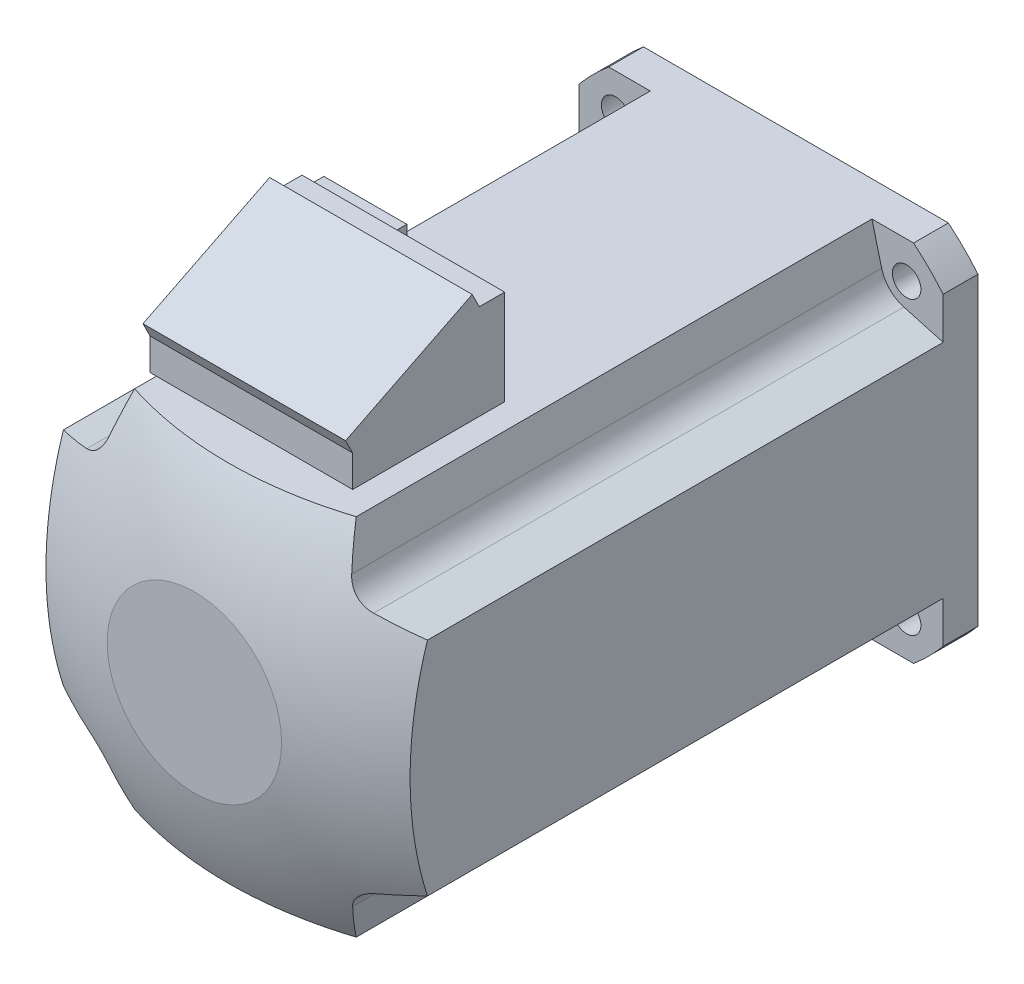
ISO-10303-21;
HEADER;
FILE_DESCRIPTION(('STEP AP214'),'2;1');
FILE_NAME('part.step','',(''),(''),'','','');
FILE_SCHEMA(('AUTOMOTIVE_DESIGN { 1 0 10303 214 1 1 1 1 }'));
ENDSEC;
DATA;
#1=APPLICATION_CONTEXT('core data for automotive mechanical design processes');
#2=APPLICATION_PROTOCOL_DEFINITION('international standard','automotive_design',2000,#1);
#3=PRODUCT_CONTEXT('',#1,'mechanical');
#4=PRODUCT('Part','Part','',(#3));
#5=PRODUCT_RELATED_PRODUCT_CATEGORY('part','',(#4));
#6=PRODUCT_DEFINITION_FORMATION('','',#4);
#7=PRODUCT_DEFINITION_CONTEXT('part definition',#1,'design');
#8=PRODUCT_DEFINITION('design','',#6,#7);
#9=PRODUCT_DEFINITION_SHAPE('','',#8);
#10=(LENGTH_UNIT() NAMED_UNIT(*) SI_UNIT(.MILLI.,.METRE.));
#11=(NAMED_UNIT(*) PLANE_ANGLE_UNIT() SI_UNIT($,.RADIAN.));
#12=(NAMED_UNIT(*) SI_UNIT($,.STERADIAN.) SOLID_ANGLE_UNIT());
#13=UNCERTAINTY_MEASURE_WITH_UNIT(LENGTH_MEASURE(1.E-05),#10,'distance_accuracy_value','');
#14=(GEOMETRIC_REPRESENTATION_CONTEXT(3) GLOBAL_UNCERTAINTY_ASSIGNED_CONTEXT((#13)) GLOBAL_UNIT_ASSIGNED_CONTEXT((#10,
#11,#12)) REPRESENTATION_CONTEXT('',''));
#15=CARTESIAN_POINT('',(0.,0.,0.));
#16=DIRECTION('',(0.,0.,1.));
#17=DIRECTION('',(1.,0.,0.));
#18=AXIS2_PLACEMENT_3D('',#15,#16,#17);
#19=CARTESIAN_POINT('',(32.,92.5,124.));
#20=DIRECTION('',(0.,0.,1.));
#21=DIRECTION('',(1.,0.,0.));
#22=AXIS2_PLACEMENT_3D('',#19,#20,#21);
#23=PLANE('',#22);
#24=DIRECTION('',(0.,-1.,0.));
#25=VECTOR('',#24,1.);
#26=CARTESIAN_POINT('',(26.4,88.4,124.));
#27=LINE('',#26,#25);
#28=CARTESIAN_POINT('',(26.4,88.4,124.));
#29=VERTEX_POINT('',#28);
#30=CARTESIAN_POINT('',(26.4,64.6,124.));
#31=VERTEX_POINT('',#30);
#32=EDGE_CURVE('E388',#29,#31,#27,.T.);
#33=ORIENTED_EDGE('',*,*,#32,.F.);
#34=DIRECTION('',(1.,0.,0.));
#35=VECTOR('',#34,1.);
#36=CARTESIAN_POINT('',(26.4,88.4,124.));
#37=LINE('',#36,#35);
#38=CARTESIAN_POINT('',(2.6,88.4,124.));
#39=VERTEX_POINT('',#38);
#40=EDGE_CURVE('E397',#39,#29,#37,.T.);
#41=ORIENTED_EDGE('',*,*,#40,.F.);
#42=DIRECTION('',(0.,1.,0.));
#43=VECTOR('',#42,1.);
#44=CARTESIAN_POINT('',(2.6,88.4,124.));
#45=LINE('',#44,#43);
#46=CARTESIAN_POINT('',(2.6,64.6,124.));
#47=VERTEX_POINT('',#46);
#48=EDGE_CURVE('E394',#47,#39,#45,.T.);
#49=ORIENTED_EDGE('',*,*,#48,.F.);
#50=DIRECTION('',(-1.,0.,0.));
#51=VECTOR('',#50,1.);
#52=CARTESIAN_POINT('',(26.4,64.6,124.));
#53=LINE('',#52,#51);
#54=EDGE_CURVE('E391',#31,#47,#53,.T.);
#55=ORIENTED_EDGE('',*,*,#54,.F.);
#56=EDGE_LOOP('',(#33,#41,#49,#55));
#57=FACE_BOUND('',#56,.T.);
#58=DIRECTION('',(0.,-1.,0.));
#59=VECTOR('',#58,1.);
#60=CARTESIAN_POINT('',(32.,92.5,124.));
#61=LINE('',#60,#59);
#62=CARTESIAN_POINT('',(32.,92.5,124.));
#63=VERTEX_POINT('',#62);
#64=CARTESIAN_POINT('',(32.,62.5,124.));
#65=VERTEX_POINT('',#64);
#66=EDGE_CURVE('E442',#63,#65,#61,.T.);
#67=ORIENTED_EDGE('',*,*,#66,.T.);
#68=DIRECTION('',(1.,0.,0.));
#69=VECTOR('',#68,1.);
#70=CARTESIAN_POINT('',(-57.5,62.5,124.));
#71=LINE('',#70,#69);
#72=CARTESIAN_POINT('',(-32.,62.5,124.));
#73=VERTEX_POINT('',#72);
#74=EDGE_CURVE('E315',#73,#65,#71,.T.);
#75=ORIENTED_EDGE('',*,*,#74,.F.);
#76=DIRECTION('',(0.,-1.,0.));
#77=VECTOR('',#76,1.);
#78=CARTESIAN_POINT('',(-32.,92.5,124.));
#79=LINE('',#78,#77);
#80=CARTESIAN_POINT('',(-32.,92.5,124.));
#81=VERTEX_POINT('',#80);
#82=EDGE_CURVE('E439',#81,#73,#79,.T.);
#83=ORIENTED_EDGE('',*,*,#82,.F.);
#84=DIRECTION('',(-1.,0.,0.));
#85=VECTOR('',#84,1.);
#86=CARTESIAN_POINT('',(32.,92.5,124.));
#87=LINE('',#86,#85);
#88=EDGE_CURVE('E429',#63,#81,#87,.T.);
#89=ORIENTED_EDGE('',*,*,#88,.F.);
#90=EDGE_LOOP('',(#67,#75,#83,#89));
#91=FACE_BOUND('',#90,.T.);
#92=DIRECTION('',(0.,-1.,0.));
#93=VECTOR('',#92,1.);
#94=CARTESIAN_POINT('',(-2.9,91.6,124.));
#95=LINE('',#94,#93);
#96=CARTESIAN_POINT('',(-2.9,91.6,124.));
#97=VERTEX_POINT('',#96);
#98=CARTESIAN_POINT('',(-2.9,65.4,124.));
#99=VERTEX_POINT('',#98);
#100=EDGE_CURVE('E355',#97,#99,#95,.T.);
#101=ORIENTED_EDGE('',*,*,#100,.F.);
#102=DIRECTION('',(1.,0.,0.));
#103=VECTOR('',#102,1.);
#104=CARTESIAN_POINT('',(-2.9,91.6,124.));
#105=LINE('',#104,#103);
#106=CARTESIAN_POINT('',(-29.1,91.6,124.));
#107=VERTEX_POINT('',#106);
#108=EDGE_CURVE('E364',#107,#97,#105,.T.);
#109=ORIENTED_EDGE('',*,*,#108,.F.);
#110=DIRECTION('',(0.,1.,0.));
#111=VECTOR('',#110,1.);
#112=CARTESIAN_POINT('',(-29.1,91.6,124.));
#113=LINE('',#112,#111);
#114=CARTESIAN_POINT('',(-29.1,65.4,124.));
#115=VERTEX_POINT('',#114);
#116=EDGE_CURVE('E361',#115,#107,#113,.T.);
#117=ORIENTED_EDGE('',*,*,#116,.F.);
#118=DIRECTION('',(-1.,0.,0.));
#119=VECTOR('',#118,1.);
#120=CARTESIAN_POINT('',(-2.9,65.4,124.));
#121=LINE('',#120,#119);
#122=EDGE_CURVE('E358',#99,#115,#121,.T.);
#123=ORIENTED_EDGE('',*,*,#122,.F.);
#124=EDGE_LOOP('',(#101,#109,#117,#123));
#125=FACE_BOUND('',#124,.T.);
#126=ADVANCED_FACE('F16',(#57,#91,#125),#23,.F.);
#127=CARTESIAN_POINT('',(-48.1534007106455,57.5,200.));
#128=DIRECTION('',(0.,-1.,0.));
#129=DIRECTION('',(0.,0.,-1.));
#130=AXIS2_PLACEMENT_3D('',#127,#128,#129);
#131=PLANE('',#130);
#132=DIRECTION('',(0.,0.,-1.));
#133=VECTOR('',#132,1.);
#134=CARTESIAN_POINT('',(16.,57.499999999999,190.));
#135=LINE('',#134,#133);
#136=CARTESIAN_POINT('',(16.,57.5,162.));
#137=VERTEX_POINT('',#136);
#138=CARTESIAN_POINT('',(16.,57.4999999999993,134.));
#139=VERTEX_POINT('',#138);
#140=EDGE_CURVE('E31',#137,#139,#135,.T.);
#141=ORIENTED_EDGE('',*,*,#140,.F.);
#142=DIRECTION('',(1.,0.,0.));
#143=VECTOR('',#142,1.);
#144=CARTESIAN_POINT('',(-57.5,57.5,162.));
#145=LINE('',#144,#143);
#146=CARTESIAN_POINT('',(-16.,57.4999999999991,162.));
#147=VERTEX_POINT('',#146);
#148=EDGE_CURVE('E593',#147,#137,#145,.T.);
#149=ORIENTED_EDGE('',*,*,#148,.F.);
#150=DIRECTION('',(0.,0.,-1.));
#151=VECTOR('',#150,1.);
#152=CARTESIAN_POINT('',(-16.,57.499999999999,190.));
#153=LINE('',#152,#151);
#154=CARTESIAN_POINT('',(-16.,57.4999999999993,134.));
#155=VERTEX_POINT('',#154);
#156=EDGE_CURVE('E308',#147,#155,#153,.T.);
#157=ORIENTED_EDGE('',*,*,#156,.T.);
#158=DIRECTION('',(1.,0.,0.));
#159=VECTOR('',#158,1.);
#160=CARTESIAN_POINT('',(-57.5,57.5,134.));
#161=LINE('',#160,#159);
#162=EDGE_CURVE('E303',#155,#139,#161,.T.);
#163=ORIENTED_EDGE('',*,*,#162,.T.);
#164=EDGE_LOOP('',(#141,#149,#157,#163));
#165=FACE_BOUND('',#164,.T.);
#166=CARTESIAN_POINT('',(0.,57.5,65.));
#167=DIRECTION('',(0.,-1.,0.));
#168=DIRECTION('',(0.,0.,-1.));
#169=AXIS2_PLACEMENT_3D('',#166,#167,#168);
#170=CIRCLE('',#169,114.357990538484);
#171=CARTESIAN_POINT('',(-35.,57.5,173.870335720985));
#172=VERTEX_POINT('',#171);
#173=CARTESIAN_POINT('',(35.,57.5,173.870335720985));
#174=VERTEX_POINT('',#173);
#175=EDGE_CURVE('E1258',#172,#174,#170,.F.);
#176=ORIENTED_EDGE('',*,*,#175,.T.);
#177=DIRECTION('',(0.,0.,-1.));
#178=VECTOR('',#177,1.);
#179=CARTESIAN_POINT('',(35.,57.5,200.));
#180=LINE('',#179,#178);
#181=CARTESIAN_POINT('',(35.,57.5,11.));
#182=VERTEX_POINT('',#181);
#183=EDGE_CURVE('E1125',#174,#182,#180,.T.);
#184=ORIENTED_EDGE('',*,*,#183,.T.);
#185=DIRECTION('',(-1.,0.,0.));
#186=VECTOR('',#185,1.);
#187=CARTESIAN_POINT('',(48.1534007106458,57.5,11.));
#188=LINE('',#187,#186);
#189=CARTESIAN_POINT('',(48.1534007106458,57.5,11.));
#190=VERTEX_POINT('',#189);
#191=EDGE_CURVE('E1114',#190,#182,#188,.T.);
#192=ORIENTED_EDGE('',*,*,#191,.F.);
#193=DIRECTION('',(0.,0.,-1.));
#194=VECTOR('',#193,1.);
#195=CARTESIAN_POINT('',(48.1534007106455,57.5,200.));
#196=LINE('',#195,#194);
#197=CARTESIAN_POINT('',(48.1534007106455,57.5,0.));
#198=VERTEX_POINT('',#197);
#199=EDGE_CURVE('E1185',#190,#198,#196,.T.);
#200=ORIENTED_EDGE('',*,*,#199,.T.);
#201=DIRECTION('',(-1.,0.,0.));
#202=VECTOR('',#201,1.);
#203=CARTESIAN_POINT('',(-48.1534007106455,57.5,0.));
#204=LINE('',#203,#202);
#205=CARTESIAN_POINT('',(-48.1534007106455,57.5,0.));
#206=VERTEX_POINT('',#205);
#207=EDGE_CURVE('E1150',#198,#206,#204,.T.);
#208=ORIENTED_EDGE('',*,*,#207,.T.);
#209=DIRECTION('',(0.,0.,-1.));
#210=VECTOR('',#209,1.);
#211=CARTESIAN_POINT('',(-48.1534007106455,57.5,200.));
#212=LINE('',#211,#210);
#213=CARTESIAN_POINT('',(-48.1534007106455,57.5,11.));
#214=VERTEX_POINT('',#213);
#215=EDGE_CURVE('E1183',#214,#206,#212,.T.);
#216=ORIENTED_EDGE('',*,*,#215,.F.);
#217=DIRECTION('',(-1.,0.,0.));
#218=VECTOR('',#217,1.);
#219=CARTESIAN_POINT('',(-35.,57.5,11.));
#220=LINE('',#219,#218);
#221=CARTESIAN_POINT('',(-35.,57.5,11.));
#222=VERTEX_POINT('',#221);
#223=EDGE_CURVE('E1127',#222,#214,#220,.T.);
#224=ORIENTED_EDGE('',*,*,#223,.F.);
#225=DIRECTION('',(0.,0.,-1.));
#226=VECTOR('',#225,1.);
#227=CARTESIAN_POINT('',(-35.,57.5,200.));
#228=LINE('',#227,#226);
#229=EDGE_CURVE('E1140',#172,#222,#228,.T.);
#230=ORIENTED_EDGE('',*,*,#229,.F.);
#231=EDGE_LOOP('',(#176,#184,#192,#200,#208,#216,#224,#230));
#232=FACE_BOUND('',#231,.T.);
#233=ADVANCED_FACE('F306',(#165,#232),#131,.F.);
#234=CARTESIAN_POINT('',(0.,0.,65.));
#235=DIRECTION('',(0.,0.,1.));
#236=DIRECTION('',(1.,0.,0.));
#237=AXIS2_PLACEMENT_3D('',#234,#235,#236);
#238=SPHERICAL_SURFACE('',#237,128.);
#239=CARTESIAN_POINT('',(46.7233103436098,12.0523764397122,65.));
#240=DIRECTION('',(0.968303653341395,0.24977596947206,0.));
#241=DIRECTION('',(-0.24977596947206,0.968303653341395,0.));
#242=AXIS2_PLACEMENT_3D('',#239,#240,#241);
#243=CIRCLE('',#242,118.55662146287);
#244=CARTESIAN_POINT('',(38.0720796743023,45.5905037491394,178.384402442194));
#245=VERTEX_POINT('',#244);
#246=EDGE_CURVE('E1264',#245,#174,#243,.F.);
#247=ORIENTED_EDGE('',*,*,#246,.T.);
#248=ORIENTED_EDGE('',*,*,#175,.F.);
#249=CARTESIAN_POINT('',(-47.3272514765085,13.1568101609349,65.));
#250=DIRECTION('',(-0.96346354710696,0.267839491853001,0.));
#251=DIRECTION('',(-0.267839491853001,-0.963463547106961,0.));
#252=AXIS2_PLACEMENT_3D('',#249,#250,#251);
#253=CIRCLE('',#252,118.19911003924);
#254=CARTESIAN_POINT('',(-38.4536279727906,45.0767212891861,178.461040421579));
#255=VERTEX_POINT('',#254);
#256=EDGE_CURVE('E502',#172,#255,#253,.F.);
#257=ORIENTED_EDGE('',*,*,#256,.T.);
#258=CARTESIAN_POINT('',(-45.5907037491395,38.0720280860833,178.384339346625));
#259=CARTESIAN_POINT('',(-45.3563758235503,38.1324393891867,178.458277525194));
#260=CARTESIAN_POINT('',(-45.1229644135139,38.2017431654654,178.528010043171));
#261=CARTESIAN_POINT('',(-44.6594987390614,38.3581344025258,178.6584650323));
#262=CARTESIAN_POINT('',(-44.4294459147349,38.4452292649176,178.719183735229));
#263=CARTESIAN_POINT('',(-43.9740532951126,38.6373054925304,178.831039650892));
#264=CARTESIAN_POINT('',(-43.7487216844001,38.7423154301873,178.882161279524));
#265=CARTESIAN_POINT('',(-43.3049139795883,38.9698031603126,178.974133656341));
#266=CARTESIAN_POINT('',(-43.0864368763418,39.0922783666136,179.014985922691));
#267=CARTESIAN_POINT('',(-42.6574381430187,39.3545494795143,179.086051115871));
#268=CARTESIAN_POINT('',(-42.4469410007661,39.4943938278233,179.116233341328));
#269=CARTESIAN_POINT('',(-42.0363094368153,39.7903251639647,179.165421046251));
#270=CARTESIAN_POINT('',(-41.8361748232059,39.9464118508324,179.184426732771));
#271=CARTESIAN_POINT('',(-41.4481817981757,40.2735639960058,179.211001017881));
#272=CARTESIAN_POINT('',(-41.2603077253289,40.4446096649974,179.218584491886));
#273=CARTESIAN_POINT('',(-40.8980840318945,40.8005644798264,179.222261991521));
#274=CARTESIAN_POINT('',(-40.7237335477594,40.9854727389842,179.218356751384));
#275=CARTESIAN_POINT('',(-40.3966945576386,41.359882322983,179.199503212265));
#276=CARTESIAN_POINT('',(-40.2434127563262,41.5488891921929,179.185011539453));
#277=CARTESIAN_POINT('',(-39.9514984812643,41.9368697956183,179.145679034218));
#278=CARTESIAN_POINT('',(-39.8128659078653,42.1358434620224,179.1208382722));
#279=CARTESIAN_POINT('',(-39.5509713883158,42.5423314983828,179.061080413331));
#280=CARTESIAN_POINT('',(-39.4277162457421,42.7498495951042,179.026158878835));
#281=CARTESIAN_POINT('',(-39.197235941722,43.1717319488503,178.946643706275));
#282=CARTESIAN_POINT('',(-39.0900066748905,43.3860944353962,178.902052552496));
#283=CARTESIAN_POINT('',(-38.8810684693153,43.8439088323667,178.798273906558));
#284=CARTESIAN_POINT('',(-38.7812431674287,44.0879797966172,178.738023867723));
#285=CARTESIAN_POINT('',(-38.6021295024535,44.5799318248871,178.6071214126));
#286=CARTESIAN_POINT('',(-38.5227791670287,44.827798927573,178.536501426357));
#287=CARTESIAN_POINT('',(-38.4535723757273,45.0769212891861,178.460979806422));
#288=B_SPLINE_CURVE_WITH_KNOTS('',3,(#258,#259,#260,#261,#262,#263,#264,#265,#266,#267,#268,
#269,#270,#271,#272,#273,#274,#275,#276,#277,#278,#279,#280,#281,#282,#283,#284,#285,#286,#287),
.UNSPECIFIED.,.F.,.F.,(4,2,2,2,2,2,2,2,2,2,2,2,2,2,4),(0.,0.758977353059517,1.51827110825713,
2.27878736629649,3.0391911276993,3.80176535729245,4.56432545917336,5.32589159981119,
6.08740907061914,6.81788554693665,7.54835705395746,8.27915061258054,9.00975664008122,
9.82019902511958,10.6281588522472),.UNSPECIFIED.);
#289=CARTESIAN_POINT('',(-45.5905037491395,38.0720796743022,178.384402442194));
#290=VERTEX_POINT('',#289);
#291=EDGE_CURVE('E495',#290,#255,#288,.T.);
#292=ORIENTED_EDGE('',*,*,#291,.F.);
#293=CARTESIAN_POINT('',(-12.0523764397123,46.7233103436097,65.));
#294=DIRECTION('',(-0.249775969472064,0.968303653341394,0.));
#295=DIRECTION('',(-0.968303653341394,-0.249775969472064,0.));
#296=AXIS2_PLACEMENT_3D('',#293,#294,#295);
#297=CIRCLE('',#296,118.55662146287);
#298=CARTESIAN_POINT('',(-57.5,35.,173.870335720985));
#299=VERTEX_POINT('',#298);
#300=EDGE_CURVE('E458',#290,#299,#297,.F.);
#301=ORIENTED_EDGE('',*,*,#300,.T.);
#302=CARTESIAN_POINT('',(-57.5,0.,65.));
#303=DIRECTION('',(1.,0.,0.));
#304=DIRECTION('',(0.,0.,-1.));
#305=AXIS2_PLACEMENT_3D('',#302,#303,#304);
#306=CIRCLE('',#305,114.357990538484);
#307=CARTESIAN_POINT('',(-57.5,-34.9999999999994,173.870335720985));
#308=VERTEX_POINT('',#307);
#309=EDGE_CURVE('E450',#308,#299,#306,.F.);
#310=ORIENTED_EDGE('',*,*,#309,.F.);
#311=CARTESIAN_POINT('',(-13.1568101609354,-47.3272514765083,65.));
#312=DIRECTION('',(-0.267839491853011,-0.963463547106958,0.));
#313=DIRECTION('',(0.963463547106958,-0.267839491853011,0.));
#314=AXIS2_PLACEMENT_3D('',#311,#312,#313);
#315=CIRCLE('',#314,118.19911003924);
#316=CARTESIAN_POINT('',(-45.0767212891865,-38.4536279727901,178.461040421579));
#317=VERTEX_POINT('',#316);
#318=EDGE_CURVE('E446',#308,#317,#315,.F.);
#319=ORIENTED_EDGE('',*,*,#318,.T.);
#320=CARTESIAN_POINT('',(-38.0720280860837,-45.5907037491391,178.384339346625));
#321=CARTESIAN_POINT('',(-38.1324393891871,-45.3563758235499,178.458277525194));
#322=CARTESIAN_POINT('',(-38.2017431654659,-45.1229644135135,178.528010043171));
#323=CARTESIAN_POINT('',(-38.3581344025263,-44.659498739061,178.6584650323));
#324=CARTESIAN_POINT('',(-38.4452292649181,-44.4294459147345,178.719183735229));
#325=CARTESIAN_POINT('',(-38.6373054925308,-43.9740532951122,178.831039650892));
#326=CARTESIAN_POINT('',(-38.7423154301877,-43.7487216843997,178.882161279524));
#327=CARTESIAN_POINT('',(-38.969803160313,-43.3049139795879,178.974133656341));
#328=CARTESIAN_POINT('',(-39.092278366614,-43.0864368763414,179.014985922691));
#329=CARTESIAN_POINT('',(-39.3545494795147,-42.6574381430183,179.086051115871));
#330=CARTESIAN_POINT('',(-39.4943938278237,-42.4469410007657,179.116233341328));
#331=CARTESIAN_POINT('',(-39.7903251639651,-42.0363094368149,179.165421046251));
#332=CARTESIAN_POINT('',(-39.9464118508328,-41.8361748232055,179.184426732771));
#333=CARTESIAN_POINT('',(-40.2735639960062,-41.4481817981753,179.211001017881));
#334=CARTESIAN_POINT('',(-40.4446096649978,-41.2603077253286,179.218584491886));
#335=CARTESIAN_POINT('',(-40.8005644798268,-40.8980840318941,179.222261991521));
#336=CARTESIAN_POINT('',(-40.9854727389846,-40.723733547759,179.218356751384));
#337=CARTESIAN_POINT('',(-41.3598823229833,-40.3966945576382,179.199503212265));
#338=CARTESIAN_POINT('',(-41.5488891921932,-40.2434127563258,179.185011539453));
#339=CARTESIAN_POINT('',(-41.9368697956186,-39.9514984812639,179.145679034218));
#340=CARTESIAN_POINT('',(-42.1358434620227,-39.8128659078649,179.1208382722));
#341=CARTESIAN_POINT('',(-42.5423314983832,-39.5509713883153,179.061080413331));
#342=CARTESIAN_POINT('',(-42.7498495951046,-39.4277162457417,179.026158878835));
#343=CARTESIAN_POINT('',(-43.1717319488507,-39.1972359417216,178.946643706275));
#344=CARTESIAN_POINT('',(-43.3860944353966,-39.09000667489,178.902052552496));
#345=CARTESIAN_POINT('',(-43.8439088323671,-38.8810684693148,178.798273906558));
#346=CARTESIAN_POINT('',(-44.0879797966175,-38.7812431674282,178.738023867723));
#347=CARTESIAN_POINT('',(-44.5799318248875,-38.602129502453,178.6071214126));
#348=CARTESIAN_POINT('',(-44.8277989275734,-38.5227791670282,178.536501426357));
#349=CARTESIAN_POINT('',(-45.0769212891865,-38.4535723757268,178.460979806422));
#350=B_SPLINE_CURVE_WITH_KNOTS('',3,(#320,#321,#322,#323,#324,#325,#326,#327,#328,#329,#330,
#331,#332,#333,#334,#335,#336,#337,#338,#339,#340,#341,#342,#343,#344,#345,#346,#347,#348,#349),
.UNSPECIFIED.,.F.,.F.,(4,2,2,2,2,2,2,2,2,2,2,2,2,2,4),(0.,0.758977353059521,1.51827110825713,
2.27878736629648,3.0391911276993,3.80176535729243,4.56432545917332,5.32589159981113,
6.08740907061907,6.81788554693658,7.5483570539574,8.27915061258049,9.00975664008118,
9.82019902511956,10.6281588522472),.UNSPECIFIED.);
#351=CARTESIAN_POINT('',(-38.0720796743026,-45.5905037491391,178.384402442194));
#352=VERTEX_POINT('',#351);
#353=EDGE_CURVE('E487',#352,#317,#350,.T.);
#354=ORIENTED_EDGE('',*,*,#353,.F.);
#355=CARTESIAN_POINT('',(-46.7233103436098,-12.0523764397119,65.));
#356=DIRECTION('',(-0.968303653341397,-0.249775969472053,0.));
#357=DIRECTION('',(0.249775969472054,-0.968303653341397,0.));
#358=AXIS2_PLACEMENT_3D('',#355,#356,#357);
#359=CIRCLE('',#358,118.55662146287);
#360=CARTESIAN_POINT('',(-35.0000000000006,-57.5,173.870335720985));
#361=VERTEX_POINT('',#360);
#362=EDGE_CURVE('E448',#352,#361,#359,.F.);
#363=ORIENTED_EDGE('',*,*,#362,.T.);
#364=CARTESIAN_POINT('',(0.,-57.5,65.));
#365=DIRECTION('',(0.,1.,0.));
#366=DIRECTION('',(0.,0.,1.));
#367=AXIS2_PLACEMENT_3D('',#364,#365,#366);
#368=CIRCLE('',#367,114.357990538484);
#369=CARTESIAN_POINT('',(34.9999999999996,-57.5,173.870335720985));
#370=VERTEX_POINT('',#369);
#371=EDGE_CURVE('E453',#370,#361,#368,.F.);
#372=ORIENTED_EDGE('',*,*,#371,.F.);
#373=CARTESIAN_POINT('',(47.3272514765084,-13.1568101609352,65.));
#374=DIRECTION('',(0.963463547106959,-0.267839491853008,0.));
#375=DIRECTION('',(0.267839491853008,0.963463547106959,0.));
#376=AXIS2_PLACEMENT_3D('',#373,#374,#375);
#377=CIRCLE('',#376,118.19911003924);
#378=CARTESIAN_POINT('',(38.4536279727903,-45.0767212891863,178.461040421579));
#379=VERTEX_POINT('',#378);
#380=EDGE_CURVE('E456',#370,#379,#377,.F.);
#381=ORIENTED_EDGE('',*,*,#380,.T.);
#382=CARTESIAN_POINT('',(45.5907037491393,-38.0720280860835,178.384339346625));
#383=CARTESIAN_POINT('',(45.35637582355,-38.1324393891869,178.458277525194));
#384=CARTESIAN_POINT('',(45.1229644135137,-38.2017431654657,178.528010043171));
#385=CARTESIAN_POINT('',(44.6594987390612,-38.358134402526,178.6584650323));
#386=CARTESIAN_POINT('',(44.4294459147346,-38.4452292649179,178.719183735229));
#387=CARTESIAN_POINT('',(43.9740532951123,-38.6373054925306,178.831039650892));
#388=CARTESIAN_POINT('',(43.7487216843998,-38.7423154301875,178.882161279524));
#389=CARTESIAN_POINT('',(43.304913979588,-38.9698031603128,178.974133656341));
#390=CARTESIAN_POINT('',(43.0864368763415,-39.0922783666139,179.014985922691));
#391=CARTESIAN_POINT('',(42.6574381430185,-39.3545494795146,179.086051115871));
#392=CARTESIAN_POINT('',(42.4469410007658,-39.4943938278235,179.116233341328));
#393=CARTESIAN_POINT('',(42.036309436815,-39.7903251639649,179.165421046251));
#394=CARTESIAN_POINT('',(41.8361748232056,-39.9464118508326,179.184426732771));
#395=CARTESIAN_POINT('',(41.4481817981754,-40.273563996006,179.211001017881));
#396=CARTESIAN_POINT('',(41.2603077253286,-40.4446096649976,179.218584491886));
#397=CARTESIAN_POINT('',(40.8980840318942,-40.8005644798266,179.222261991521));
#398=CARTESIAN_POINT('',(40.7237335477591,-40.9854727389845,179.218356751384));
#399=CARTESIAN_POINT('',(40.3966945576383,-41.3598823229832,179.199503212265));
#400=CARTESIAN_POINT('',(40.2434127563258,-41.5488891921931,179.185011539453));
#401=CARTESIAN_POINT('',(39.951498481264,-41.9368697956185,179.145679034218));
#402=CARTESIAN_POINT('',(39.812865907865,-42.1358434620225,179.1208382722));
#403=CARTESIAN_POINT('',(39.5509713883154,-42.542331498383,179.061080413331));
#404=CARTESIAN_POINT('',(39.4277162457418,-42.7498495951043,179.026158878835));
#405=CARTESIAN_POINT('',(39.1972359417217,-43.1717319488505,178.946643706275));
#406=CARTESIAN_POINT('',(39.0900066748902,-43.3860944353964,178.902052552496));
#407=CARTESIAN_POINT('',(38.881068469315,-43.843908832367,178.798273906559));
#408=CARTESIAN_POINT('',(38.7812431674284,-44.0879797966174,178.738023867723));
#409=CARTESIAN_POINT('',(38.6021295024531,-44.5799318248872,178.6071214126));
#410=CARTESIAN_POINT('',(38.5227791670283,-44.8277989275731,178.536501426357));
#411=CARTESIAN_POINT('',(38.453572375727,-45.0769212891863,178.460979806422));
#412=B_SPLINE_CURVE_WITH_KNOTS('',3,(#382,#383,#384,#385,#386,#387,#388,#389,#390,#391,#392,
#393,#394,#395,#396,#397,#398,#399,#400,#401,#402,#403,#404,#405,#406,#407,#408,#409,#410,#411),
.UNSPECIFIED.,.F.,.F.,(4,2,2,2,2,2,2,2,2,2,2,2,2,2,4),(0.,0.758977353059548,1.51827110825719,
2.27878736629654,3.03919112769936,3.80176535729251,4.56432545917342,5.32589159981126,
6.08740907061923,6.81788554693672,7.5483570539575,8.27915061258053,9.00975664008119,
9.8201990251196,10.6281588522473),.UNSPECIFIED.);
#413=CARTESIAN_POINT('',(45.5905037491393,-38.0720796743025,178.384402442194));
#414=VERTEX_POINT('',#413);
#415=EDGE_CURVE('E460',#414,#379,#412,.T.);
#416=ORIENTED_EDGE('',*,*,#415,.F.);
#417=CARTESIAN_POINT('',(12.0523764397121,-46.7233103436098,65.));
#418=DIRECTION('',(0.249775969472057,-0.968303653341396,0.));
#419=DIRECTION('',(0.968303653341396,0.249775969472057,0.));
#420=AXIS2_PLACEMENT_3D('',#417,#418,#419);
#421=CIRCLE('',#420,118.55662146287);
#422=CARTESIAN_POINT('',(57.5,-35.,173.870335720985));
#423=VERTEX_POINT('',#422);
#424=EDGE_CURVE('E468',#414,#423,#421,.F.);
#425=ORIENTED_EDGE('',*,*,#424,.T.);
#426=CARTESIAN_POINT('',(57.5,0.,65.));
#427=DIRECTION('',(-1.,0.,0.));
#428=DIRECTION('',(0.,0.,1.));
#429=AXIS2_PLACEMENT_3D('',#426,#427,#428);
#430=CIRCLE('',#429,114.357990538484);
#431=CARTESIAN_POINT('',(57.5,35.,173.870335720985));
#432=VERTEX_POINT('',#431);
#433=EDGE_CURVE('E1259',#432,#423,#430,.F.);
#434=ORIENTED_EDGE('',*,*,#433,.F.);
#435=CARTESIAN_POINT('',(13.1568101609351,47.3272514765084,65.));
#436=DIRECTION('',(0.267839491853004,0.963463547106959,0.));
#437=DIRECTION('',(-0.963463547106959,0.267839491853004,0.));
#438=AXIS2_PLACEMENT_3D('',#435,#436,#437);
#439=CIRCLE('',#438,118.19911003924);
#440=CARTESIAN_POINT('',(45.0767212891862,38.4536279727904,178.461040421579));
#441=VERTEX_POINT('',#440);
#442=EDGE_CURVE('E1260',#432,#441,#439,.F.);
#443=ORIENTED_EDGE('',*,*,#442,.T.);
#444=CARTESIAN_POINT('',(38.0720280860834,45.5907037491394,178.384339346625));
#445=CARTESIAN_POINT('',(38.1324393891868,45.3563758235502,178.458277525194));
#446=CARTESIAN_POINT('',(38.2017431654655,45.1229644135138,178.528010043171));
#447=CARTESIAN_POINT('',(38.3581344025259,44.6594987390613,178.6584650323));
#448=CARTESIAN_POINT('',(38.4452292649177,44.4294459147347,178.719183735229));
#449=CARTESIAN_POINT('',(38.6373054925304,43.9740532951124,178.831039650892));
#450=CARTESIAN_POINT('',(38.7423154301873,43.7487216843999,178.882161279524));
#451=CARTESIAN_POINT('',(38.9698031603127,43.3049139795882,178.974133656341));
#452=CARTESIAN_POINT('',(39.0922783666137,43.0864368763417,179.014985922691));
#453=CARTESIAN_POINT('',(39.3545494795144,42.6574381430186,179.086051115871));
#454=CARTESIAN_POINT('',(39.4943938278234,42.446941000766,179.116233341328));
#455=CARTESIAN_POINT('',(39.7903251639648,42.0363094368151,179.165421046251));
#456=CARTESIAN_POINT('',(39.9464118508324,41.8361748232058,179.184426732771));
#457=CARTESIAN_POINT('',(40.2735639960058,41.4481817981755,179.211001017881));
#458=CARTESIAN_POINT('',(40.4446096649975,41.2603077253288,179.218584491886));
#459=CARTESIAN_POINT('',(40.8005644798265,40.8980840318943,179.222261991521));
#460=CARTESIAN_POINT('',(40.9854727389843,40.7237335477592,179.218356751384));
#461=CARTESIAN_POINT('',(41.3598823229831,40.3966945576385,179.199503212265));
#462=CARTESIAN_POINT('',(41.5488891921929,40.243412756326,179.185011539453));
#463=CARTESIAN_POINT('',(41.9368697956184,39.9514984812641,179.145679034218));
#464=CARTESIAN_POINT('',(42.1358434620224,39.8128659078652,179.1208382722));
#465=CARTESIAN_POINT('',(42.5423314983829,39.5509713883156,179.061080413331));
#466=CARTESIAN_POINT('',(42.7498495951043,39.4277162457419,179.026158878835));
#467=CARTESIAN_POINT('',(43.1717319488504,39.1972359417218,178.946643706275));
#468=CARTESIAN_POINT('',(43.3860944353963,39.0900066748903,178.902052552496));
#469=CARTESIAN_POINT('',(43.8439088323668,38.8810684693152,178.798273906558));
#470=CARTESIAN_POINT('',(44.0879797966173,38.7812431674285,178.738023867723));
#471=CARTESIAN_POINT('',(44.5799318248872,38.6021295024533,178.6071214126));
#472=CARTESIAN_POINT('',(44.8277989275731,38.5227791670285,178.536501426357));
#473=CARTESIAN_POINT('',(45.0769212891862,38.4535723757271,178.460979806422));
#474=B_SPLINE_CURVE_WITH_KNOTS('',3,(#444,#445,#446,#447,#448,#449,#450,#451,#452,#453,#454,
#455,#456,#457,#458,#459,#460,#461,#462,#463,#464,#465,#466,#467,#468,#469,#470,#471,#472,#473),
.UNSPECIFIED.,.F.,.F.,(4,2,2,2,2,2,2,2,2,2,2,2,2,2,4),(0.,0.758977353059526,1.51827110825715,
2.2787873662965,3.03919112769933,3.80176535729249,4.56432545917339,5.32589159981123,
6.08740907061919,6.8178855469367,7.54835705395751,8.2791506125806,9.00975664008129,
9.82019902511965,10.6281588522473),.UNSPECIFIED.);
#475=EDGE_CURVE('E1265',#245,#441,#474,.T.);
#476=ORIENTED_EDGE('',*,*,#475,.F.);
#477=EDGE_LOOP('',(#247,#248,#257,#292,#301,#310,#319,#354,#363,#372,#381,#416,#425,#434,#443,#476));
#478=FACE_BOUND('',#477,.T.);
#479=CARTESIAN_POINT('',(0.,0.,190.));
#480=DIRECTION('',(0.,0.,1.));
#481=DIRECTION('',(1.,0.,0.));
#482=AXIS2_PLACEMENT_3D('',#479,#480,#481);
#483=CIRCLE('',#482,27.5499546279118);
#484=CARTESIAN_POINT('',(27.5499546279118,0.,190.));
#485=VERTEX_POINT('',#484);
#486=EDGE_CURVE('E445',#485,#485,#483,.T.);
#487=ORIENTED_EDGE('',*,*,#486,.F.);
#488=EDGE_LOOP('',(#487));
#489=FACE_BOUND('',#488,.T.);
#490=ADVANCED_FACE('F474',(#478,#489),#238,.T.);
#491=CARTESIAN_POINT('',(-48.1534007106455,-57.5,200.));
#492=DIRECTION('',(0.,1.,0.));
#493=DIRECTION('',(0.,0.,1.));
#494=AXIS2_PLACEMENT_3D('',#491,#492,#493);
#495=PLANE('',#494);
#496=DIRECTION('',(0.,0.,-1.));
#497=VECTOR('',#496,1.);
#498=CARTESIAN_POINT('',(34.9999999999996,-57.5,200.));
#499=LINE('',#498,#497);
#500=CARTESIAN_POINT('',(34.9999999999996,-57.5,11.));
#501=VERTEX_POINT('',#500);
#502=EDGE_CURVE('E1218',#370,#501,#499,.T.);
#503=ORIENTED_EDGE('',*,*,#502,.F.);
#504=ORIENTED_EDGE('',*,*,#371,.T.);
#505=DIRECTION('',(0.,0.,-1.));
#506=VECTOR('',#505,1.);
#507=CARTESIAN_POINT('',(-35.0000000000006,-57.5,200.));
#508=LINE('',#507,#506);
#509=CARTESIAN_POINT('',(-35.0000000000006,-57.5,11.));
#510=VERTEX_POINT('',#509);
#511=EDGE_CURVE('E1286',#361,#510,#508,.T.);
#512=ORIENTED_EDGE('',*,*,#511,.T.);
#513=DIRECTION('',(1.,0.,0.));
#514=VECTOR('',#513,1.);
#515=CARTESIAN_POINT('',(-48.1534007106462,-57.5,11.));
#516=LINE('',#515,#514);
#517=CARTESIAN_POINT('',(-48.1534007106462,-57.5,11.));
#518=VERTEX_POINT('',#517);
#519=EDGE_CURVE('E1276',#518,#510,#516,.T.);
#520=ORIENTED_EDGE('',*,*,#519,.F.);
#521=DIRECTION('',(0.,0.,-1.));
#522=VECTOR('',#521,1.);
#523=CARTESIAN_POINT('',(-48.1534007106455,-57.5,200.));
#524=LINE('',#523,#522);
#525=CARTESIAN_POINT('',(-48.1534007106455,-57.5,0.));
#526=VERTEX_POINT('',#525);
#527=EDGE_CURVE('E1177',#518,#526,#524,.T.);
#528=ORIENTED_EDGE('',*,*,#527,.T.);
#529=DIRECTION('',(1.,0.,0.));
#530=VECTOR('',#529,1.);
#531=CARTESIAN_POINT('',(-48.1534007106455,-57.5,0.));
#532=LINE('',#531,#530);
#533=CARTESIAN_POINT('',(48.1534007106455,-57.5,0.));
#534=VERTEX_POINT('',#533);
#535=EDGE_CURVE('E1162',#526,#534,#532,.T.);
#536=ORIENTED_EDGE('',*,*,#535,.T.);
#537=DIRECTION('',(0.,0.,-1.));
#538=VECTOR('',#537,1.);
#539=CARTESIAN_POINT('',(48.1534007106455,-57.5,200.));
#540=LINE('',#539,#538);
#541=CARTESIAN_POINT('',(48.1534007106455,-57.5,11.));
#542=VERTEX_POINT('',#541);
#543=EDGE_CURVE('E1175',#542,#534,#540,.T.);
#544=ORIENTED_EDGE('',*,*,#543,.F.);
#545=DIRECTION('',(1.,0.,0.));
#546=VECTOR('',#545,1.);
#547=CARTESIAN_POINT('',(34.9999999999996,-57.5,11.));
#548=LINE('',#547,#546);
#549=EDGE_CURVE('E1288',#501,#542,#548,.T.);
#550=ORIENTED_EDGE('',*,*,#549,.F.);
#551=EDGE_LOOP('',(#503,#504,#512,#520,#528,#536,#544,#550));
#552=FACE_BOUND('',#551,.T.);
#553=ADVANCED_FACE('F478',(#552),#495,.F.);
#554=CARTESIAN_POINT('',(-57.5,48.1534007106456,200.));
#555=DIRECTION('',(1.,0.,0.));
#556=DIRECTION('',(0.,0.,-1.));
#557=AXIS2_PLACEMENT_3D('',#554,#555,#556);
#558=PLANE('',#557);
#559=DIRECTION('',(0.,0.,-1.));
#560=VECTOR('',#559,1.);
#561=CARTESIAN_POINT('',(-57.5,-34.9999999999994,200.));
#562=LINE('',#561,#560);
#563=CARTESIAN_POINT('',(-57.5,-34.9999999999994,11.));
#564=VERTEX_POINT('',#563);
#565=EDGE_CURVE('E1284',#308,#564,#562,.T.);
#566=ORIENTED_EDGE('',*,*,#565,.F.);
#567=ORIENTED_EDGE('',*,*,#309,.T.);
#568=DIRECTION('',(0.,0.,-1.));
#569=VECTOR('',#568,1.);
#570=CARTESIAN_POINT('',(-57.5,35.,200.));
#571=LINE('',#570,#569);
#572=CARTESIAN_POINT('',(-57.5,35.,11.));
#573=VERTEX_POINT('',#572);
#574=EDGE_CURVE('E1142',#299,#573,#571,.T.);
#575=ORIENTED_EDGE('',*,*,#574,.T.);
#576=DIRECTION('',(0.,-1.,0.));
#577=VECTOR('',#576,1.);
#578=CARTESIAN_POINT('',(-57.5,48.1534007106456,11.));
#579=LINE('',#578,#577);
#580=CARTESIAN_POINT('',(-57.5,48.1534007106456,11.));
#581=VERTEX_POINT('',#580);
#582=EDGE_CURVE('E1131',#581,#573,#579,.T.);
#583=ORIENTED_EDGE('',*,*,#582,.F.);
#584=DIRECTION('',(0.,0.,-1.));
#585=VECTOR('',#584,1.);
#586=CARTESIAN_POINT('',(-57.5,48.1534007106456,200.));
#587=LINE('',#586,#585);
#588=CARTESIAN_POINT('',(-57.5,48.1534007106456,0.));
#589=VERTEX_POINT('',#588);
#590=EDGE_CURVE('E1181',#581,#589,#587,.T.);
#591=ORIENTED_EDGE('',*,*,#590,.T.);
#592=DIRECTION('',(0.,-1.,0.));
#593=VECTOR('',#592,1.);
#594=CARTESIAN_POINT('',(-57.5,48.1534007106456,0.));
#595=LINE('',#594,#593);
#596=CARTESIAN_POINT('',(-57.5,-48.1534007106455,0.));
#597=VERTEX_POINT('',#596);
#598=EDGE_CURVE('E1156',#589,#597,#595,.T.);
#599=ORIENTED_EDGE('',*,*,#598,.T.);
#600=DIRECTION('',(0.,0.,-1.));
#601=VECTOR('',#600,1.);
#602=CARTESIAN_POINT('',(-57.5,-48.1534007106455,200.));
#603=LINE('',#602,#601);
#604=CARTESIAN_POINT('',(-57.5,-48.1534007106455,11.));
#605=VERTEX_POINT('',#604);
#606=EDGE_CURVE('E1179',#605,#597,#603,.T.);
#607=ORIENTED_EDGE('',*,*,#606,.F.);
#608=DIRECTION('',(0.,-1.,0.));
#609=VECTOR('',#608,1.);
#610=CARTESIAN_POINT('',(-57.5,-34.9999999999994,11.));
#611=LINE('',#610,#609);
#612=EDGE_CURVE('E1271',#564,#605,#611,.T.);
#613=ORIENTED_EDGE('',*,*,#612,.F.);
#614=EDGE_LOOP('',(#566,#567,#575,#583,#591,#599,#607,#613));
#615=FACE_BOUND('',#614,.T.);
#616=ADVANCED_FACE('F548',(#615),#558,.F.);
#617=CARTESIAN_POINT('',(0.,0.,200.));
#618=DIRECTION('',(0.,0.,-1.));
#619=DIRECTION('',(-1.,0.,0.));
#620=AXIS2_PLACEMENT_3D('',#617,#618,#619);
#621=CYLINDRICAL_SURFACE('',#620,75.);
#622=CARTESIAN_POINT('',(0.,0.,11.));
#623=DIRECTION('',(0.,0.,1.));
#624=DIRECTION('',(0.,1.,0.));
#625=AXIS2_PLACEMENT_3D('',#622,#623,#624);
#626=CIRCLE('',#625,75.);
#627=EDGE_CURVE('E1274',#605,#518,#626,.T.);
#628=ORIENTED_EDGE('',*,*,#627,.F.);
#629=ORIENTED_EDGE('',*,*,#606,.T.);
#630=CARTESIAN_POINT('',(0.,0.,0.));
#631=DIRECTION('',(0.,0.,1.));
#632=DIRECTION('',(1.,0.,0.));
#633=AXIS2_PLACEMENT_3D('',#630,#631,#632);
#634=CIRCLE('',#633,75.);
#635=EDGE_CURVE('E1159',#597,#526,#634,.T.);
#636=ORIENTED_EDGE('',*,*,#635,.T.);
#637=ORIENTED_EDGE('',*,*,#527,.F.);
#638=EDGE_LOOP('',(#628,#629,#636,#637));
#639=FACE_BOUND('',#638,.T.);
#640=ADVANCED_FACE('F541',(#639),#621,.T.);
#641=CARTESIAN_POINT('',(57.5,48.1534007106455,200.));
#642=DIRECTION('',(-1.,0.,0.));
#643=DIRECTION('',(0.,0.,1.));
#644=AXIS2_PLACEMENT_3D('',#641,#642,#643);
#645=PLANE('',#644);
#646=DIRECTION('',(0.,0.,-1.));
#647=VECTOR('',#646,1.);
#648=CARTESIAN_POINT('',(57.5,35.,200.));
#649=LINE('',#648,#647);
#650=CARTESIAN_POINT('',(57.5,35.,11.));
#651=VERTEX_POINT('',#650);
#652=EDGE_CURVE('E1118',#432,#651,#649,.T.);
#653=ORIENTED_EDGE('',*,*,#652,.F.);
#654=ORIENTED_EDGE('',*,*,#433,.T.);
#655=DIRECTION('',(0.,0.,-1.));
#656=VECTOR('',#655,1.);
#657=CARTESIAN_POINT('',(57.5,-35.,200.));
#658=LINE('',#657,#656);
#659=CARTESIAN_POINT('',(57.5,-35.,11.));
#660=VERTEX_POINT('',#659);
#661=EDGE_CURVE('E1224',#423,#660,#658,.T.);
#662=ORIENTED_EDGE('',*,*,#661,.T.);
#663=DIRECTION('',(0.,1.,0.));
#664=VECTOR('',#663,1.);
#665=CARTESIAN_POINT('',(57.5,-48.153400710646,11.));
#666=LINE('',#665,#664);
#667=CARTESIAN_POINT('',(57.5,-48.153400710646,11.));
#668=VERTEX_POINT('',#667);
#669=EDGE_CURVE('E1292',#668,#660,#666,.T.);
#670=ORIENTED_EDGE('',*,*,#669,.F.);
#671=DIRECTION('',(0.,0.,-1.));
#672=VECTOR('',#671,1.);
#673=CARTESIAN_POINT('',(57.5,-48.1534007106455,200.));
#674=LINE('',#673,#672);
#675=CARTESIAN_POINT('',(57.5,-48.1534007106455,0.));
#676=VERTEX_POINT('',#675);
#677=EDGE_CURVE('E1173',#668,#676,#674,.T.);
#678=ORIENTED_EDGE('',*,*,#677,.T.);
#679=DIRECTION('',(0.,1.,0.));
#680=VECTOR('',#679,1.);
#681=CARTESIAN_POINT('',(57.5,48.1534007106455,0.));
#682=LINE('',#681,#680);
#683=CARTESIAN_POINT('',(57.5,48.1534007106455,0.));
#684=VERTEX_POINT('',#683);
#685=EDGE_CURVE('E1168',#676,#684,#682,.T.);
#686=ORIENTED_EDGE('',*,*,#685,.T.);
#687=DIRECTION('',(0.,0.,-1.));
#688=VECTOR('',#687,1.);
#689=CARTESIAN_POINT('',(57.5,48.1534007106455,200.));
#690=LINE('',#689,#688);
#691=CARTESIAN_POINT('',(57.5,48.1534007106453,11.));
#692=VERTEX_POINT('',#691);
#693=EDGE_CURVE('E1171',#692,#684,#690,.T.);
#694=ORIENTED_EDGE('',*,*,#693,.F.);
#695=DIRECTION('',(0.,1.,0.));
#696=VECTOR('',#695,1.);
#697=CARTESIAN_POINT('',(57.5,35.,11.));
#698=LINE('',#697,#696);
#699=EDGE_CURVE('E1226',#651,#692,#698,.T.);
#700=ORIENTED_EDGE('',*,*,#699,.F.);
#701=EDGE_LOOP('',(#653,#654,#662,#670,#678,#686,#694,#700));
#702=FACE_BOUND('',#701,.T.);
#703=ADVANCED_FACE('F537',(#702),#645,.F.);
#704=CARTESIAN_POINT('',(0.,0.,200.));
#705=DIRECTION('',(0.,0.,-1.));
#706=DIRECTION('',(-1.,0.,0.));
#707=AXIS2_PLACEMENT_3D('',#704,#705,#706);
#708=CYLINDRICAL_SURFACE('',#707,75.);
#709=CARTESIAN_POINT('',(0.,0.,11.));
#710=DIRECTION('',(0.,0.,1.));
#711=DIRECTION('',(-1.,0.,0.));
#712=AXIS2_PLACEMENT_3D('',#709,#710,#711);
#713=CIRCLE('',#712,75.);
#714=EDGE_CURVE('E1290',#542,#668,#713,.T.);
#715=ORIENTED_EDGE('',*,*,#714,.F.);
#716=ORIENTED_EDGE('',*,*,#543,.T.);
#717=CARTESIAN_POINT('',(0.,0.,0.));
#718=DIRECTION('',(0.,0.,1.));
#719=DIRECTION('',(1.,0.,0.));
#720=AXIS2_PLACEMENT_3D('',#717,#718,#719);
#721=CIRCLE('',#720,75.);
#722=EDGE_CURVE('E1165',#534,#676,#721,.T.);
#723=ORIENTED_EDGE('',*,*,#722,.T.);
#724=ORIENTED_EDGE('',*,*,#677,.F.);
#725=EDGE_LOOP('',(#715,#716,#723,#724));
#726=FACE_BOUND('',#725,.T.);
#727=ADVANCED_FACE('F540',(#726),#708,.T.);
#728=CARTESIAN_POINT('',(0.,0.,200.));
#729=DIRECTION('',(0.,0.,-1.));
#730=DIRECTION('',(-1.,0.,0.));
#731=AXIS2_PLACEMENT_3D('',#728,#729,#730);
#732=CYLINDRICAL_SURFACE('',#731,75.);
#733=CARTESIAN_POINT('',(0.,0.,11.));
#734=DIRECTION('',(0.,0.,1.));
#735=DIRECTION('',(0.,-1.,0.));
#736=AXIS2_PLACEMENT_3D('',#733,#734,#735);
#737=CIRCLE('',#736,75.);
#738=EDGE_CURVE('E1120',#692,#190,#737,.T.);
#739=ORIENTED_EDGE('',*,*,#738,.F.);
#740=ORIENTED_EDGE('',*,*,#693,.T.);
#741=CARTESIAN_POINT('',(0.,0.,0.));
#742=DIRECTION('',(0.,0.,1.));
#743=DIRECTION('',(1.,0.,0.));
#744=AXIS2_PLACEMENT_3D('',#741,#742,#743);
#745=CIRCLE('',#744,75.);
#746=EDGE_CURVE('E1147',#684,#198,#745,.T.);
#747=ORIENTED_EDGE('',*,*,#746,.T.);
#748=ORIENTED_EDGE('',*,*,#199,.F.);
#749=EDGE_LOOP('',(#739,#740,#747,#748));
#750=FACE_BOUND('',#749,.T.);
#751=ADVANCED_FACE('F18',(#750),#732,.T.);
#752=CARTESIAN_POINT('',(0.,0.,200.));
#753=DIRECTION('',(0.,0.,-1.));
#754=DIRECTION('',(-1.,0.,0.));
#755=AXIS2_PLACEMENT_3D('',#752,#753,#754);
#756=CYLINDRICAL_SURFACE('',#755,75.);
#757=CARTESIAN_POINT('',(0.,0.,11.));
#758=DIRECTION('',(0.,0.,1.));
#759=DIRECTION('',(1.,0.,0.));
#760=AXIS2_PLACEMENT_3D('',#757,#758,#759);
#761=CIRCLE('',#760,75.);
#762=EDGE_CURVE('E1129',#214,#581,#761,.T.);
#763=ORIENTED_EDGE('',*,*,#762,.F.);
#764=ORIENTED_EDGE('',*,*,#215,.T.);
#765=CARTESIAN_POINT('',(0.,0.,0.));
#766=DIRECTION('',(0.,0.,1.));
#767=DIRECTION('',(1.,0.,0.));
#768=AXIS2_PLACEMENT_3D('',#765,#766,#767);
#769=CIRCLE('',#768,75.);
#770=EDGE_CURVE('E1153',#206,#589,#769,.T.);
#771=ORIENTED_EDGE('',*,*,#770,.T.);
#772=ORIENTED_EDGE('',*,*,#590,.F.);
#773=EDGE_LOOP('',(#763,#764,#771,#772));
#774=FACE_BOUND('',#773,.T.);
#775=ADVANCED_FACE('F535',(#774),#756,.T.);
#776=CARTESIAN_POINT('',(0.,0.,0.));
#777=DIRECTION('',(0.,0.,1.));
#778=DIRECTION('',(1.,0.,0.));
#779=AXIS2_PLACEMENT_3D('',#776,#777,#778);
#780=PLANE('',#779);
#781=CARTESIAN_POINT('',(-45.9619407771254,45.9619407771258,0.));
#782=DIRECTION('',(0.,0.,-1.));
#783=DIRECTION('',(0.,1.,0.));
#784=AXIS2_PLACEMENT_3D('',#781,#782,#783);
#785=CIRCLE('',#784,4.5);
#786=CARTESIAN_POINT('',(-45.9619407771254,50.4619407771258,0.));
#787=VERTEX_POINT('',#786);
#788=EDGE_CURVE('E339',#787,#787,#785,.T.);
#789=ORIENTED_EDGE('',*,*,#788,.F.);
#790=EDGE_LOOP('',(#789));
#791=FACE_BOUND('',#790,.T.);
#792=CARTESIAN_POINT('',(-45.9619407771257,-45.9619407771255,0.));
#793=DIRECTION('',(0.,0.,-1.));
#794=DIRECTION('',(0.,1.,0.));
#795=AXIS2_PLACEMENT_3D('',#792,#793,#794);
#796=CIRCLE('',#795,4.5);
#797=CARTESIAN_POINT('',(-45.9619407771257,-41.4619407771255,0.));
#798=VERTEX_POINT('',#797);
#799=EDGE_CURVE('E343',#798,#798,#796,.T.);
#800=ORIENTED_EDGE('',*,*,#799,.F.);
#801=EDGE_LOOP('',(#800));
#802=FACE_BOUND('',#801,.T.);
#803=CARTESIAN_POINT('',(45.9619407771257,-45.9619407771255,0.));
#804=DIRECTION('',(0.,0.,-1.));
#805=DIRECTION('',(0.,1.,0.));
#806=AXIS2_PLACEMENT_3D('',#803,#804,#805);
#807=CIRCLE('',#806,4.5);
#808=CARTESIAN_POINT('',(45.9619407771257,-41.4619407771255,0.));
#809=VERTEX_POINT('',#808);
#810=EDGE_CURVE('E347',#809,#809,#807,.T.);
#811=ORIENTED_EDGE('',*,*,#810,.F.);
#812=EDGE_LOOP('',(#811));
#813=FACE_BOUND('',#812,.T.);
#814=CARTESIAN_POINT('',(45.9619407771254,45.9619407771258,0.));
#815=DIRECTION('',(0.,0.,-1.));
#816=DIRECTION('',(-1.,0.,0.));
#817=AXIS2_PLACEMENT_3D('',#814,#815,#816);
#818=CIRCLE('',#817,4.5);
#819=CARTESIAN_POINT('',(41.4619407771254,45.9619407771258,0.));
#820=VERTEX_POINT('',#819);
#821=EDGE_CURVE('E351',#820,#820,#818,.T.);
#822=ORIENTED_EDGE('',*,*,#821,.F.);
#823=EDGE_LOOP('',(#822));
#824=FACE_BOUND('',#823,.T.);
#825=ORIENTED_EDGE('',*,*,#746,.F.);
#826=ORIENTED_EDGE('',*,*,#685,.F.);
#827=ORIENTED_EDGE('',*,*,#722,.F.);
#828=ORIENTED_EDGE('',*,*,#535,.F.);
#829=ORIENTED_EDGE('',*,*,#635,.F.);
#830=ORIENTED_EDGE('',*,*,#598,.F.);
#831=ORIENTED_EDGE('',*,*,#770,.F.);
#832=ORIENTED_EDGE('',*,*,#207,.F.);
#833=EDGE_LOOP('',(#825,#826,#827,#828,#829,#830,#831,#832));
#834=FACE_BOUND('',#833,.T.);
#835=CARTESIAN_POINT('',(0.,0.,0.));
#836=DIRECTION('',(0.,0.,1.));
#837=DIRECTION('',(1.,0.,0.));
#838=AXIS2_PLACEMENT_3D('',#835,#836,#837);
#839=CIRCLE('',#838,40.);
#840=CARTESIAN_POINT('',(40.,0.,0.));
#841=VERTEX_POINT('',#840);
#842=EDGE_CURVE('E1187',#841,#841,#839,.F.);
#843=ORIENTED_EDGE('',*,*,#842,.F.);
#844=EDGE_LOOP('',(#843));
#845=FACE_BOUND('',#844,.T.);
#846=ADVANCED_FACE('F531',(#791,#802,#813,#824,#834,#845),#780,.F.);
#847=CARTESIAN_POINT('',(0.,0.,-3.));
#848=DIRECTION('',(0.,0.,1.));
#849=DIRECTION('',(1.,0.,0.));
#850=AXIS2_PLACEMENT_3D('',#847,#848,#849);
#851=CYLINDRICAL_SURFACE('',#850,40.);
#852=CARTESIAN_POINT('',(0.,0.,-3.));
#853=DIRECTION('',(0.,0.,-1.));
#854=DIRECTION('',(-1.,0.,0.));
#855=AXIS2_PLACEMENT_3D('',#852,#853,#854);
#856=CIRCLE('',#855,40.);
#857=CARTESIAN_POINT('',(-40.,0.,-3.));
#858=VERTEX_POINT('',#857);
#859=EDGE_CURVE('E1144',#858,#858,#856,.T.);
#860=ORIENTED_EDGE('',*,*,#859,.F.);
#861=EDGE_LOOP('',(#860));
#862=FACE_BOUND('',#861,.T.);
#863=ORIENTED_EDGE('',*,*,#842,.T.);
#864=EDGE_LOOP('',(#863));
#865=FACE_BOUND('',#864,.T.);
#866=ADVANCED_FACE('F527',(#862,#865),#851,.T.);
#867=CARTESIAN_POINT('',(0.,0.,-3.));
#868=DIRECTION('',(0.,0.,-1.));
#869=DIRECTION('',(-1.,0.,0.));
#870=AXIS2_PLACEMENT_3D('',#867,#868,#869);
#871=PLANE('',#870);
#872=ORIENTED_EDGE('',*,*,#859,.T.);
#873=EDGE_LOOP('',(#872));
#874=FACE_BOUND('',#873,.T.);
#875=ADVANCED_FACE('F523',(#874),#871,.T.);
#876=CARTESIAN_POINT('',(-40.,39.5141619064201,200.));
#877=DIRECTION('',(-0.249775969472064,0.968303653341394,0.));
#878=DIRECTION('',(-0.968303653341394,-0.249775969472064,0.));
#879=AXIS2_PLACEMENT_3D('',#876,#877,#878);
#880=PLANE('',#879);
#881=ORIENTED_EDGE('',*,*,#300,.F.);
#882=DIRECTION('',(0.,0.,-1.));
#883=VECTOR('',#882,1.);
#884=CARTESIAN_POINT('',(-45.5905037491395,38.0720796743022,11.));
#885=LINE('',#884,#883);
#886=CARTESIAN_POINT('',(-45.5905037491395,38.0720796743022,11.));
#887=VERTEX_POINT('',#886);
#888=EDGE_CURVE('E1190',#290,#887,#885,.T.);
#889=ORIENTED_EDGE('',*,*,#888,.T.);
#890=DIRECTION('',(0.968303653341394,0.249775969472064,0.));
#891=VECTOR('',#890,1.);
#892=CARTESIAN_POINT('',(-40.,39.5141619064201,11.));
#893=LINE('',#892,#891);
#894=EDGE_CURVE('E1134',#573,#887,#893,.T.);
#895=ORIENTED_EDGE('',*,*,#894,.F.);
#896=ORIENTED_EDGE('',*,*,#574,.F.);
#897=EDGE_LOOP('',(#881,#889,#895,#896));
#898=FACE_BOUND('',#897,.T.);
#899=ADVANCED_FACE('F519',(#898),#880,.T.);
#900=CARTESIAN_POINT('',(-35.,57.5,200.));
#901=DIRECTION('',(-0.96346354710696,0.267839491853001,0.));
#902=DIRECTION('',(-0.267839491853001,-0.963463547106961,0.));
#903=AXIS2_PLACEMENT_3D('',#900,#901,#902);
#904=PLANE('',#903);
#905=ORIENTED_EDGE('',*,*,#256,.F.);
#906=ORIENTED_EDGE('',*,*,#229,.T.);
#907=DIRECTION('',(0.267839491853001,0.96346354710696,0.));
#908=VECTOR('',#907,1.);
#909=CARTESIAN_POINT('',(-35.,57.5,11.));
#910=LINE('',#909,#908);
#911=CARTESIAN_POINT('',(-38.4536279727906,45.0767212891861,11.));
#912=VERTEX_POINT('',#911);
#913=EDGE_CURVE('E1137',#912,#222,#910,.T.);
#914=ORIENTED_EDGE('',*,*,#913,.F.);
#915=DIRECTION('',(0.,0.,-1.));
#916=VECTOR('',#915,1.);
#917=CARTESIAN_POINT('',(-38.4536279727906,45.0767212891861,200.));
#918=LINE('',#917,#916);
#919=EDGE_CURVE('E1194',#912,#255,#918,.F.);
#920=ORIENTED_EDGE('',*,*,#919,.T.);
#921=EDGE_LOOP('',(#905,#906,#914,#920));
#922=FACE_BOUND('',#921,.T.);
#923=ADVANCED_FACE('F515',(#922),#904,.T.);
#924=CARTESIAN_POINT('',(0.,0.,11.));
#925=DIRECTION('',(0.,0.,1.));
#926=DIRECTION('',(1.,0.,0.));
#927=AXIS2_PLACEMENT_3D('',#924,#925,#926);
#928=PLANE('',#927);
#929=CARTESIAN_POINT('',(-45.9619407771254,45.9619407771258,11.));
#930=DIRECTION('',(0.,0.,1.));
#931=DIRECTION('',(1.,0.,0.));
#932=AXIS2_PLACEMENT_3D('',#929,#930,#931);
#933=CIRCLE('',#932,4.5);
#934=CARTESIAN_POINT('',(-41.4619407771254,45.9619407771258,11.));
#935=VERTEX_POINT('',#934);
#936=EDGE_CURVE('E342',#935,#935,#933,.T.);
#937=ORIENTED_EDGE('',*,*,#936,.F.);
#938=EDGE_LOOP('',(#937));
#939=FACE_BOUND('',#938,.T.);
#940=ORIENTED_EDGE('',*,*,#894,.T.);
#941=CARTESIAN_POINT('',(-48.0882634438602,47.7551162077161,11.));
#942=DIRECTION('',(0.,0.,1.));
#943=DIRECTION('',(1.,0.,0.));
#944=AXIS2_PLACEMENT_3D('',#941,#942,#943);
#945=CIRCLE('',#944,10.);
#946=EDGE_CURVE('E1192',#887,#912,#945,.T.);
#947=ORIENTED_EDGE('',*,*,#946,.T.);
#948=ORIENTED_EDGE('',*,*,#913,.T.);
#949=ORIENTED_EDGE('',*,*,#223,.T.);
#950=ORIENTED_EDGE('',*,*,#762,.T.);
#951=ORIENTED_EDGE('',*,*,#582,.T.);
#952=EDGE_LOOP('',(#940,#947,#948,#949,#950,#951));
#953=FACE_BOUND('',#952,.T.);
#954=ADVANCED_FACE('F510',(#939,#953),#928,.T.);
#955=CARTESIAN_POINT('',(-48.0882634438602,47.7551162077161,200.));
#956=DIRECTION('',(0.,0.,1.));
#957=DIRECTION('',(1.,0.,0.));
#958=AXIS2_PLACEMENT_3D('',#955,#956,#957);
#959=CYLINDRICAL_SURFACE('',#958,10.);
#960=ORIENTED_EDGE('',*,*,#888,.F.);
#961=ORIENTED_EDGE('',*,*,#291,.T.);
#962=ORIENTED_EDGE('',*,*,#919,.F.);
#963=ORIENTED_EDGE('',*,*,#946,.F.);
#964=EDGE_LOOP('',(#960,#961,#962,#963));
#965=FACE_BOUND('',#964,.T.);
#966=ADVANCED_FACE('F504',(#965),#959,.F.);
#967=CARTESIAN_POINT('',(39.5141619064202,40.,200.));
#968=DIRECTION('',(0.968303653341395,0.24977596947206,0.));
#969=DIRECTION('',(-0.24977596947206,0.968303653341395,0.));
#970=AXIS2_PLACEMENT_3D('',#967,#968,#969);
#971=PLANE('',#970);
#972=ORIENTED_EDGE('',*,*,#246,.F.);
#973=DIRECTION('',(0.,0.,-1.));
#974=VECTOR('',#973,1.);
#975=CARTESIAN_POINT('',(38.0720796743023,45.5905037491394,11.));
#976=LINE('',#975,#974);
#977=CARTESIAN_POINT('',(38.0720796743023,45.5905037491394,11.));
#978=VERTEX_POINT('',#977);
#979=EDGE_CURVE('E1197',#245,#978,#976,.T.);
#980=ORIENTED_EDGE('',*,*,#979,.T.);
#981=DIRECTION('',(0.24977596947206,-0.968303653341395,0.));
#982=VECTOR('',#981,1.);
#983=CARTESIAN_POINT('',(39.5141619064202,40.,11.));
#984=LINE('',#983,#982);
#985=EDGE_CURVE('E1108',#182,#978,#984,.T.);
#986=ORIENTED_EDGE('',*,*,#985,.F.);
#987=ORIENTED_EDGE('',*,*,#183,.F.);
#988=EDGE_LOOP('',(#972,#980,#986,#987));
#989=FACE_BOUND('',#988,.T.);
#990=ADVANCED_FACE('F509',(#989),#971,.T.);
#991=CARTESIAN_POINT('',(57.5,35.,200.));
#992=DIRECTION('',(0.267839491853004,0.963463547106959,0.));
#993=DIRECTION('',(-0.963463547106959,0.267839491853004,0.));
#994=AXIS2_PLACEMENT_3D('',#991,#992,#993);
#995=PLANE('',#994);
#996=ORIENTED_EDGE('',*,*,#442,.F.);
#997=ORIENTED_EDGE('',*,*,#652,.T.);
#998=DIRECTION('',(0.96346354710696,-0.267839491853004,0.));
#999=VECTOR('',#998,1.);
#1000=CARTESIAN_POINT('',(57.5,35.,11.));
#1001=LINE('',#1000,#999);
#1002=CARTESIAN_POINT('',(45.0767212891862,38.4536279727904,11.));
#1003=VERTEX_POINT('',#1002);
#1004=EDGE_CURVE('E1116',#1003,#651,#1001,.T.);
#1005=ORIENTED_EDGE('',*,*,#1004,.F.);
#1006=DIRECTION('',(0.,0.,-1.));
#1007=VECTOR('',#1006,1.);
#1008=CARTESIAN_POINT('',(45.0767212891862,38.4536279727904,200.));
#1009=LINE('',#1008,#1007);
#1010=EDGE_CURVE('E1200',#1003,#441,#1009,.F.);
#1011=ORIENTED_EDGE('',*,*,#1010,.T.);
#1012=EDGE_LOOP('',(#996,#997,#1005,#1011));
#1013=FACE_BOUND('',#1012,.T.);
#1014=ADVANCED_FACE('F714',(#1013),#995,.T.);
#1015=CARTESIAN_POINT('',(0.,0.,11.));
#1016=DIRECTION('',(0.,0.,1.));
#1017=DIRECTION('',(0.,-1.,0.));
#1018=AXIS2_PLACEMENT_3D('',#1015,#1016,#1017);
#1019=PLANE('',#1018);
#1020=CARTESIAN_POINT('',(45.9619407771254,45.9619407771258,11.));
#1021=DIRECTION('',(0.,0.,1.));
#1022=DIRECTION('',(1.,0.,0.));
#1023=AXIS2_PLACEMENT_3D('',#1020,#1021,#1022);
#1024=CIRCLE('',#1023,4.5);
#1025=CARTESIAN_POINT('',(50.4619407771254,45.9619407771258,11.));
#1026=VERTEX_POINT('',#1025);
#1027=EDGE_CURVE('E354',#1026,#1026,#1024,.T.);
#1028=ORIENTED_EDGE('',*,*,#1027,.F.);
#1029=EDGE_LOOP('',(#1028));
#1030=FACE_BOUND('',#1029,.T.);
#1031=ORIENTED_EDGE('',*,*,#985,.T.);
#1032=CARTESIAN_POINT('',(47.7551162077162,48.08826344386,11.));
#1033=DIRECTION('',(0.,0.,1.));
#1034=DIRECTION('',(1.,0.,0.));
#1035=AXIS2_PLACEMENT_3D('',#1032,#1033,#1034);
#1036=CIRCLE('',#1035,10.);
#1037=EDGE_CURVE('E1111',#978,#1003,#1036,.T.);
#1038=ORIENTED_EDGE('',*,*,#1037,.T.);
#1039=ORIENTED_EDGE('',*,*,#1004,.T.);
#1040=ORIENTED_EDGE('',*,*,#699,.T.);
#1041=ORIENTED_EDGE('',*,*,#738,.T.);
#1042=ORIENTED_EDGE('',*,*,#191,.T.);
#1043=EDGE_LOOP('',(#1031,#1038,#1039,#1040,#1041,#1042));
#1044=FACE_BOUND('',#1043,.T.);
#1045=ADVANCED_FACE('F722',(#1030,#1044),#1019,.T.);
#1046=CARTESIAN_POINT('',(40.,-39.5141619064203,200.));
#1047=DIRECTION('',(0.249775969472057,-0.968303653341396,0.));
#1048=DIRECTION('',(0.968303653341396,0.249775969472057,0.));
#1049=AXIS2_PLACEMENT_3D('',#1046,#1047,#1048);
#1050=PLANE('',#1049);
#1051=ORIENTED_EDGE('',*,*,#424,.F.);
#1052=DIRECTION('',(0.,0.,-1.));
#1053=VECTOR('',#1052,1.);
#1054=CARTESIAN_POINT('',(45.5905037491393,-38.0720796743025,11.));
#1055=LINE('',#1054,#1053);
#1056=CARTESIAN_POINT('',(45.5905037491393,-38.0720796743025,11.));
#1057=VERTEX_POINT('',#1056);
#1058=EDGE_CURVE('E1203',#414,#1057,#1055,.T.);
#1059=ORIENTED_EDGE('',*,*,#1058,.T.);
#1060=DIRECTION('',(-0.968303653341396,-0.249775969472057,0.));
#1061=VECTOR('',#1060,1.);
#1062=CARTESIAN_POINT('',(40.,-39.5141619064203,11.));
#1063=LINE('',#1062,#1061);
#1064=EDGE_CURVE('E1213',#660,#1057,#1063,.T.);
#1065=ORIENTED_EDGE('',*,*,#1064,.F.);
#1066=ORIENTED_EDGE('',*,*,#661,.F.);
#1067=EDGE_LOOP('',(#1051,#1059,#1065,#1066));
#1068=FACE_BOUND('',#1067,.T.);
#1069=ADVANCED_FACE('F730',(#1068),#1050,.T.);
#1070=CARTESIAN_POINT('',(34.9999999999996,-57.5,200.));
#1071=DIRECTION('',(0.963463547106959,-0.267839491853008,0.));
#1072=DIRECTION('',(0.267839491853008,0.963463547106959,0.));
#1073=AXIS2_PLACEMENT_3D('',#1070,#1071,#1072);
#1074=PLANE('',#1073);
#1075=ORIENTED_EDGE('',*,*,#380,.F.);
#1076=ORIENTED_EDGE('',*,*,#502,.T.);
#1077=DIRECTION('',(-0.267839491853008,-0.963463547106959,0.));
#1078=VECTOR('',#1077,1.);
#1079=CARTESIAN_POINT('',(34.9999999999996,-57.5,11.));
#1080=LINE('',#1079,#1078);
#1081=CARTESIAN_POINT('',(38.4536279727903,-45.0767212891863,11.));
#1082=VERTEX_POINT('',#1081);
#1083=EDGE_CURVE('E1209',#1082,#501,#1080,.T.);
#1084=ORIENTED_EDGE('',*,*,#1083,.F.);
#1085=DIRECTION('',(0.,0.,-1.));
#1086=VECTOR('',#1085,1.);
#1087=CARTESIAN_POINT('',(38.4536279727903,-45.0767212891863,200.));
#1088=LINE('',#1087,#1086);
#1089=EDGE_CURVE('E1080',#1082,#379,#1088,.F.);
#1090=ORIENTED_EDGE('',*,*,#1089,.T.);
#1091=EDGE_LOOP('',(#1075,#1076,#1084,#1090));
#1092=FACE_BOUND('',#1091,.T.);
#1093=ADVANCED_FACE('F739',(#1092),#1074,.T.);
#1094=CARTESIAN_POINT('',(0.,0.,11.));
#1095=DIRECTION('',(0.,0.,1.));
#1096=DIRECTION('',(-1.,0.,0.));
#1097=AXIS2_PLACEMENT_3D('',#1094,#1095,#1096);
#1098=PLANE('',#1097);
#1099=CARTESIAN_POINT('',(45.9619407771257,-45.9619407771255,11.));
#1100=DIRECTION('',(0.,0.,1.));
#1101=DIRECTION('',(1.,0.,0.));
#1102=AXIS2_PLACEMENT_3D('',#1099,#1100,#1101);
#1103=CIRCLE('',#1102,4.5);
#1104=CARTESIAN_POINT('',(50.4619407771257,-45.9619407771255,11.));
#1105=VERTEX_POINT('',#1104);
#1106=EDGE_CURVE('E350',#1105,#1105,#1103,.T.);
#1107=ORIENTED_EDGE('',*,*,#1106,.F.);
#1108=EDGE_LOOP('',(#1107));
#1109=FACE_BOUND('',#1108,.T.);
#1110=ORIENTED_EDGE('',*,*,#1064,.T.);
#1111=CARTESIAN_POINT('',(48.0882634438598,-47.7551162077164,11.));
#1112=DIRECTION('',(0.,0.,1.));
#1113=DIRECTION('',(1.,0.,0.));
#1114=AXIS2_PLACEMENT_3D('',#1111,#1112,#1113);
#1115=CIRCLE('',#1114,10.);
#1116=EDGE_CURVE('E1085',#1057,#1082,#1115,.T.);
#1117=ORIENTED_EDGE('',*,*,#1116,.T.);
#1118=ORIENTED_EDGE('',*,*,#1083,.T.);
#1119=ORIENTED_EDGE('',*,*,#549,.T.);
#1120=ORIENTED_EDGE('',*,*,#714,.T.);
#1121=ORIENTED_EDGE('',*,*,#669,.T.);
#1122=EDGE_LOOP('',(#1110,#1117,#1118,#1119,#1120,#1121));
#1123=FACE_BOUND('',#1122,.T.);
#1124=ADVANCED_FACE('F748',(#1109,#1123),#1098,.T.);
#1125=CARTESIAN_POINT('',(-39.5141619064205,-40.,200.));
#1126=DIRECTION('',(-0.968303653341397,-0.249775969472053,0.));
#1127=DIRECTION('',(0.249775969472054,-0.968303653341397,0.));
#1128=AXIS2_PLACEMENT_3D('',#1125,#1126,#1127);
#1129=PLANE('',#1128);
#1130=ORIENTED_EDGE('',*,*,#362,.F.);
#1131=DIRECTION('',(0.,0.,-1.));
#1132=VECTOR('',#1131,1.);
#1133=CARTESIAN_POINT('',(-38.0720796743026,-45.5905037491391,11.));
#1134=LINE('',#1133,#1132);
#1135=CARTESIAN_POINT('',(-38.0720796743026,-45.5905037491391,11.));
#1136=VERTEX_POINT('',#1135);
#1137=EDGE_CURVE('E1073',#352,#1136,#1134,.T.);
#1138=ORIENTED_EDGE('',*,*,#1137,.T.);
#1139=DIRECTION('',(-0.249775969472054,0.968303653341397,0.));
#1140=VECTOR('',#1139,1.);
#1141=CARTESIAN_POINT('',(-39.5141619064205,-40.,11.));
#1142=LINE('',#1141,#1140);
#1143=EDGE_CURVE('E1279',#510,#1136,#1142,.T.);
#1144=ORIENTED_EDGE('',*,*,#1143,.F.);
#1145=ORIENTED_EDGE('',*,*,#511,.F.);
#1146=EDGE_LOOP('',(#1130,#1138,#1144,#1145));
#1147=FACE_BOUND('',#1146,.T.);
#1148=ADVANCED_FACE('F757',(#1147),#1129,.T.);
#1149=CARTESIAN_POINT('',(-57.5,-34.9999999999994,200.));
#1150=DIRECTION('',(-0.267839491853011,-0.963463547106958,0.));
#1151=DIRECTION('',(0.963463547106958,-0.267839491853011,0.));
#1152=AXIS2_PLACEMENT_3D('',#1149,#1150,#1151);
#1153=PLANE('',#1152);
#1154=ORIENTED_EDGE('',*,*,#318,.F.);
#1155=ORIENTED_EDGE('',*,*,#565,.T.);
#1156=DIRECTION('',(-0.963463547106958,0.267839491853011,0.));
#1157=VECTOR('',#1156,1.);
#1158=CARTESIAN_POINT('',(-57.5,-34.9999999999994,11.));
#1159=LINE('',#1158,#1157);
#1160=CARTESIAN_POINT('',(-45.0767212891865,-38.4536279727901,11.));
#1161=VERTEX_POINT('',#1160);
#1162=EDGE_CURVE('E1281',#1161,#564,#1159,.T.);
#1163=ORIENTED_EDGE('',*,*,#1162,.F.);
#1164=DIRECTION('',(0.,0.,-1.));
#1165=VECTOR('',#1164,1.);
#1166=CARTESIAN_POINT('',(-45.0767212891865,-38.4536279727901,200.));
#1167=LINE('',#1166,#1165);
#1168=EDGE_CURVE('E1082',#1161,#317,#1167,.F.);
#1169=ORIENTED_EDGE('',*,*,#1168,.T.);
#1170=EDGE_LOOP('',(#1154,#1155,#1163,#1169));
#1171=FACE_BOUND('',#1170,.T.);
#1172=ADVANCED_FACE('F766',(#1171),#1153,.T.);
#1173=CARTESIAN_POINT('',(0.,0.,11.));
#1174=DIRECTION('',(0.,0.,1.));
#1175=DIRECTION('',(0.,1.,0.));
#1176=AXIS2_PLACEMENT_3D('',#1173,#1174,#1175);
#1177=PLANE('',#1176);
#1178=CARTESIAN_POINT('',(-45.9619407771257,-45.9619407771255,11.));
#1179=DIRECTION('',(0.,0.,1.));
#1180=DIRECTION('',(1.,0.,0.));
#1181=AXIS2_PLACEMENT_3D('',#1178,#1179,#1180);
#1182=CIRCLE('',#1181,4.5);
#1183=CARTESIAN_POINT('',(-41.4619407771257,-45.9619407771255,11.));
#1184=VERTEX_POINT('',#1183);
#1185=EDGE_CURVE('E346',#1184,#1184,#1182,.T.);
#1186=ORIENTED_EDGE('',*,*,#1185,.F.);
#1187=EDGE_LOOP('',(#1186));
#1188=FACE_BOUND('',#1187,.T.);
#1189=ORIENTED_EDGE('',*,*,#1143,.T.);
#1190=CARTESIAN_POINT('',(-47.7551162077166,-48.0882634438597,11.));
#1191=DIRECTION('',(0.,0.,1.));
#1192=DIRECTION('',(1.,0.,0.));
#1193=AXIS2_PLACEMENT_3D('',#1190,#1191,#1192);
#1194=CIRCLE('',#1193,10.);
#1195=EDGE_CURVE('E1076',#1136,#1161,#1194,.T.);
#1196=ORIENTED_EDGE('',*,*,#1195,.T.);
#1197=ORIENTED_EDGE('',*,*,#1162,.T.);
#1198=ORIENTED_EDGE('',*,*,#612,.T.);
#1199=ORIENTED_EDGE('',*,*,#627,.T.);
#1200=ORIENTED_EDGE('',*,*,#519,.T.);
#1201=EDGE_LOOP('',(#1189,#1196,#1197,#1198,#1199,#1200));
#1202=FACE_BOUND('',#1201,.T.);
#1203=ADVANCED_FACE('F775',(#1188,#1202),#1177,.T.);
#1204=CARTESIAN_POINT('',(47.7551162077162,48.08826344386,200.));
#1205=DIRECTION('',(0.,0.,1.));
#1206=DIRECTION('',(1.,0.,0.));
#1207=AXIS2_PLACEMENT_3D('',#1204,#1205,#1206);
#1208=CYLINDRICAL_SURFACE('',#1207,10.);
#1209=ORIENTED_EDGE('',*,*,#979,.F.);
#1210=ORIENTED_EDGE('',*,*,#475,.T.);
#1211=ORIENTED_EDGE('',*,*,#1010,.F.);
#1212=ORIENTED_EDGE('',*,*,#1037,.F.);
#1213=EDGE_LOOP('',(#1209,#1210,#1211,#1212));
#1214=FACE_BOUND('',#1213,.T.);
#1215=ADVANCED_FACE('F784',(#1214),#1208,.F.);
#1216=CARTESIAN_POINT('',(48.0882634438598,-47.7551162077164,200.));
#1217=DIRECTION('',(0.,0.,1.));
#1218=DIRECTION('',(1.,0.,0.));
#1219=AXIS2_PLACEMENT_3D('',#1216,#1217,#1218);
#1220=CYLINDRICAL_SURFACE('',#1219,10.);
#1221=ORIENTED_EDGE('',*,*,#1058,.F.);
#1222=ORIENTED_EDGE('',*,*,#415,.T.);
#1223=ORIENTED_EDGE('',*,*,#1089,.F.);
#1224=ORIENTED_EDGE('',*,*,#1116,.F.);
#1225=EDGE_LOOP('',(#1221,#1222,#1223,#1224));
#1226=FACE_BOUND('',#1225,.T.);
#1227=ADVANCED_FACE('F470',(#1226),#1220,.F.);
#1228=CARTESIAN_POINT('',(-47.7551162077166,-48.0882634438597,200.));
#1229=DIRECTION('',(0.,0.,1.));
#1230=DIRECTION('',(1.,0.,0.));
#1231=AXIS2_PLACEMENT_3D('',#1228,#1229,#1230);
#1232=CYLINDRICAL_SURFACE('',#1231,10.);
#1233=ORIENTED_EDGE('',*,*,#1137,.F.);
#1234=ORIENTED_EDGE('',*,*,#353,.T.);
#1235=ORIENTED_EDGE('',*,*,#1168,.F.);
#1236=ORIENTED_EDGE('',*,*,#1195,.F.);
#1237=EDGE_LOOP('',(#1233,#1234,#1235,#1236));
#1238=FACE_BOUND('',#1237,.T.);
#1239=ADVANCED_FACE('F482',(#1238),#1232,.F.);
#1240=CARTESIAN_POINT('',(-40.,-40.,190.));
#1241=DIRECTION('',(0.,0.,1.));
#1242=DIRECTION('',(1.,0.,0.));
#1243=AXIS2_PLACEMENT_3D('',#1240,#1241,#1242);
#1244=PLANE('',#1243);
#1245=ORIENTED_EDGE('',*,*,#486,.T.);
#1246=EDGE_LOOP('',(#1245));
#1247=FACE_BOUND('',#1246,.T.);
#1248=ADVANCED_FACE('F480',(#1247),#1244,.T.);
#1249=CARTESIAN_POINT('',(32.,92.5,124.));
#1250=DIRECTION('',(-1.,0.,0.));
#1251=DIRECTION('',(0.,0.,1.));
#1252=AXIS2_PLACEMENT_3D('',#1249,#1250,#1251);
#1253=PLANE('',#1252);
#1254=DIRECTION('',(0.,-1.,0.));
#1255=VECTOR('',#1254,1.);
#1256=CARTESIAN_POINT('',(32.,92.5,172.));
#1257=LINE('',#1256,#1255);
#1258=CARTESIAN_POINT('',(32.,72.5,172.));
#1259=VERTEX_POINT('',#1258);
#1260=CARTESIAN_POINT('',(32.,62.5,172.));
#1261=VERTEX_POINT('',#1260);
#1262=EDGE_CURVE('E433',#1259,#1261,#1257,.T.);
#1263=ORIENTED_EDGE('',*,*,#1262,.T.);
#1264=DIRECTION('',(0.,0.,1.));
#1265=VECTOR('',#1264,1.);
#1266=CARTESIAN_POINT('',(32.,62.5,134.));
#1267=LINE('',#1266,#1265);
#1268=EDGE_CURVE('E318',#65,#1261,#1267,.T.);
#1269=ORIENTED_EDGE('',*,*,#1268,.F.);
#1270=ORIENTED_EDGE('',*,*,#66,.F.);
#1271=DIRECTION('',(0.,0.,-1.));
#1272=VECTOR('',#1271,1.);
#1273=CARTESIAN_POINT('',(32.,92.5,124.));
#1274=LINE('',#1273,#1272);
#1275=CARTESIAN_POINT('',(32.,92.5,132.));
#1276=VERTEX_POINT('',#1275);
#1277=EDGE_CURVE('E425',#1276,#63,#1274,.T.);
#1278=ORIENTED_EDGE('',*,*,#1277,.F.);
#1279=DIRECTION('',(0.,-0.894427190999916,-0.447213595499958));
#1280=VECTOR('',#1279,1.);
#1281=CARTESIAN_POINT('',(32.,96.9721359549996,134.2360679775));
#1282=LINE('',#1281,#1280);
#1283=CARTESIAN_POINT('',(32.,96.9721359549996,134.2360679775));
#1284=VERTEX_POINT('',#1283);
#1285=EDGE_CURVE('E333',#1284,#1276,#1282,.T.);
#1286=ORIENTED_EDGE('',*,*,#1285,.F.);
#1287=DIRECTION('',(0.,0.447213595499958,-0.894427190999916));
#1288=VECTOR('',#1287,1.);
#1289=CARTESIAN_POINT('',(32.,76.9721359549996,174.2360679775));
#1290=LINE('',#1289,#1288);
#1291=CARTESIAN_POINT('',(32.,76.9721359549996,174.2360679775));
#1292=VERTEX_POINT('',#1291);
#1293=EDGE_CURVE('E313',#1292,#1284,#1290,.T.);
#1294=ORIENTED_EDGE('',*,*,#1293,.F.);
#1295=DIRECTION('',(0.,-0.894427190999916,-0.447213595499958));
#1296=VECTOR('',#1295,1.);
#1297=CARTESIAN_POINT('',(32.,76.9721359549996,174.2360679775));
#1298=LINE('',#1297,#1296);
#1299=EDGE_CURVE('E336',#1292,#1259,#1298,.T.);
#1300=ORIENTED_EDGE('',*,*,#1299,.T.);
#1301=EDGE_LOOP('',(#1263,#1269,#1270,#1278,#1286,#1294,#1300));
#1302=FACE_BOUND('',#1301,.T.);
#1303=ADVANCED_FACE('F572',(#1302),#1253,.F.);
#1304=CARTESIAN_POINT('',(-32.,92.5,124.));
#1305=DIRECTION('',(1.,0.,0.));
#1306=DIRECTION('',(0.,0.,-1.));
#1307=AXIS2_PLACEMENT_3D('',#1304,#1305,#1306);
#1308=PLANE('',#1307);
#1309=DIRECTION('',(0.,0.,1.));
#1310=VECTOR('',#1309,1.);
#1311=CARTESIAN_POINT('',(-32.,62.5,124.));
#1312=LINE('',#1311,#1310);
#1313=CARTESIAN_POINT('',(-32.,62.5,172.));
#1314=VERTEX_POINT('',#1313);
#1315=EDGE_CURVE('E589',#73,#1314,#1312,.T.);
#1316=ORIENTED_EDGE('',*,*,#1315,.T.);
#1317=DIRECTION('',(0.,-1.,0.));
#1318=VECTOR('',#1317,1.);
#1319=CARTESIAN_POINT('',(-32.,92.5,172.));
#1320=LINE('',#1319,#1318);
#1321=CARTESIAN_POINT('',(-32.,72.5,172.));
#1322=VERTEX_POINT('',#1321);
#1323=EDGE_CURVE('E436',#1322,#1314,#1320,.T.);
#1324=ORIENTED_EDGE('',*,*,#1323,.F.);
#1325=DIRECTION('',(0.,-0.894427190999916,-0.447213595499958));
#1326=VECTOR('',#1325,1.);
#1327=CARTESIAN_POINT('',(-32.,76.9721359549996,174.2360679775));
#1328=LINE('',#1327,#1326);
#1329=CARTESIAN_POINT('',(-32.,76.9721359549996,174.2360679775));
#1330=VERTEX_POINT('',#1329);
#1331=EDGE_CURVE('E327',#1330,#1322,#1328,.T.);
#1332=ORIENTED_EDGE('',*,*,#1331,.F.);
#1333=DIRECTION('',(0.,-0.447213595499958,0.894427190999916));
#1334=VECTOR('',#1333,1.);
#1335=CARTESIAN_POINT('',(-32.,96.9721359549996,134.2360679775));
#1336=LINE('',#1335,#1334);
#1337=CARTESIAN_POINT('',(-32.,96.9721359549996,134.2360679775));
#1338=VERTEX_POINT('',#1337);
#1339=EDGE_CURVE('E325',#1338,#1330,#1336,.T.);
#1340=ORIENTED_EDGE('',*,*,#1339,.F.);
#1341=DIRECTION('',(0.,-0.894427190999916,-0.447213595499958));
#1342=VECTOR('',#1341,1.);
#1343=CARTESIAN_POINT('',(-32.,96.9721359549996,134.2360679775));
#1344=LINE('',#1343,#1342);
#1345=CARTESIAN_POINT('',(-32.,92.5,132.));
#1346=VERTEX_POINT('',#1345);
#1347=EDGE_CURVE('E330',#1338,#1346,#1344,.T.);
#1348=ORIENTED_EDGE('',*,*,#1347,.T.);
#1349=DIRECTION('',(0.,0.,1.));
#1350=VECTOR('',#1349,1.);
#1351=CARTESIAN_POINT('',(-32.,92.5,124.));
#1352=LINE('',#1351,#1350);
#1353=EDGE_CURVE('E431',#81,#1346,#1352,.T.);
#1354=ORIENTED_EDGE('',*,*,#1353,.F.);
#1355=ORIENTED_EDGE('',*,*,#82,.T.);
#1356=EDGE_LOOP('',(#1316,#1324,#1332,#1340,#1348,#1354,#1355));
#1357=FACE_BOUND('',#1356,.T.);
#1358=ADVANCED_FACE('F570',(#1357),#1308,.F.);
#1359=CARTESIAN_POINT('',(32.,92.5,172.));
#1360=DIRECTION('',(0.,0.,-1.));
#1361=DIRECTION('',(-1.,0.,0.));
#1362=AXIS2_PLACEMENT_3D('',#1359,#1360,#1361);
#1363=PLANE('',#1362);
#1364=ORIENTED_EDGE('',*,*,#1323,.T.);
#1365=DIRECTION('',(1.,0.,0.));
#1366=VECTOR('',#1365,1.);
#1367=CARTESIAN_POINT('',(32.,62.5,172.));
#1368=LINE('',#1367,#1366);
#1369=EDGE_CURVE('E24',#1314,#1261,#1368,.T.);
#1370=ORIENTED_EDGE('',*,*,#1369,.T.);
#1371=ORIENTED_EDGE('',*,*,#1262,.F.);
#1372=DIRECTION('',(-1.,0.,0.));
#1373=VECTOR('',#1372,1.);
#1374=CARTESIAN_POINT('',(57.501,72.5,172.));
#1375=LINE('',#1374,#1373);
#1376=EDGE_CURVE('E422',#1259,#1322,#1375,.T.);
#1377=ORIENTED_EDGE('',*,*,#1376,.T.);
#1378=EDGE_LOOP('',(#1364,#1370,#1371,#1377));
#1379=FACE_BOUND('',#1378,.T.);
#1380=ADVANCED_FACE('F577',(#1379),#1363,.F.);
#1381=CARTESIAN_POINT('',(32.,92.5,172.));
#1382=DIRECTION('',(0.,-1.,0.));
#1383=DIRECTION('',(0.,0.,-1.));
#1384=AXIS2_PLACEMENT_3D('',#1381,#1382,#1383);
#1385=PLANE('',#1384);
#1386=ORIENTED_EDGE('',*,*,#1353,.T.);
#1387=DIRECTION('',(-1.,0.,0.));
#1388=VECTOR('',#1387,1.);
#1389=CARTESIAN_POINT('',(57.501,92.5,132.));
#1390=LINE('',#1389,#1388);
#1391=EDGE_CURVE('E421',#1276,#1346,#1390,.T.);
#1392=ORIENTED_EDGE('',*,*,#1391,.F.);
#1393=ORIENTED_EDGE('',*,*,#1277,.T.);
#1394=ORIENTED_EDGE('',*,*,#88,.T.);
#1395=EDGE_LOOP('',(#1386,#1392,#1393,#1394));
#1396=FACE_BOUND('',#1395,.T.);
#1397=ADVANCED_FACE('F688',(#1396),#1385,.F.);
#1398=CARTESIAN_POINT('',(26.4,88.4,120.));
#1399=DIRECTION('',(-1.,0.,0.));
#1400=DIRECTION('',(0.,0.,1.));
#1401=AXIS2_PLACEMENT_3D('',#1398,#1399,#1400);
#1402=PLANE('',#1401);
#1403=ORIENTED_EDGE('',*,*,#32,.T.);
#1404=DIRECTION('',(0.,0.,1.));
#1405=VECTOR('',#1404,1.);
#1406=CARTESIAN_POINT('',(26.4,64.6,120.));
#1407=LINE('',#1406,#1405);
#1408=CARTESIAN_POINT('',(26.4,64.6,120.));
#1409=VERTEX_POINT('',#1408);
#1410=EDGE_CURVE('E418',#1409,#31,#1407,.T.);
#1411=ORIENTED_EDGE('',*,*,#1410,.F.);
#1412=DIRECTION('',(0.,-1.,0.));
#1413=VECTOR('',#1412,1.);
#1414=CARTESIAN_POINT('',(26.4,88.4,120.));
#1415=LINE('',#1414,#1413);
#1416=CARTESIAN_POINT('',(26.4,88.4,120.));
#1417=VERTEX_POINT('',#1416);
#1418=EDGE_CURVE('E400',#1417,#1409,#1415,.T.);
#1419=ORIENTED_EDGE('',*,*,#1418,.F.);
#1420=DIRECTION('',(0.,0.,1.));
#1421=VECTOR('',#1420,1.);
#1422=CARTESIAN_POINT('',(26.4,88.4,120.));
#1423=LINE('',#1422,#1421);
#1424=EDGE_CURVE('E409',#1417,#29,#1423,.T.);
#1425=ORIENTED_EDGE('',*,*,#1424,.T.);
#1426=EDGE_LOOP('',(#1403,#1411,#1419,#1425));
#1427=FACE_BOUND('',#1426,.T.);
#1428=ADVANCED_FACE('F684',(#1427),#1402,.F.);
#1429=CARTESIAN_POINT('',(26.4,64.6,120.));
#1430=DIRECTION('',(0.,1.,0.));
#1431=DIRECTION('',(0.,0.,1.));
#1432=AXIS2_PLACEMENT_3D('',#1429,#1430,#1431);
#1433=PLANE('',#1432);
#1434=ORIENTED_EDGE('',*,*,#54,.T.);
#1435=DIRECTION('',(0.,0.,1.));
#1436=VECTOR('',#1435,1.);
#1437=CARTESIAN_POINT('',(2.6,64.6,120.));
#1438=LINE('',#1437,#1436);
#1439=CARTESIAN_POINT('',(2.6,64.6,120.));
#1440=VERTEX_POINT('',#1439);
#1441=EDGE_CURVE('E415',#1440,#47,#1438,.T.);
#1442=ORIENTED_EDGE('',*,*,#1441,.F.);
#1443=DIRECTION('',(-1.,0.,0.));
#1444=VECTOR('',#1443,1.);
#1445=CARTESIAN_POINT('',(26.4,64.6,120.));
#1446=LINE('',#1445,#1444);
#1447=EDGE_CURVE('E403',#1409,#1440,#1446,.T.);
#1448=ORIENTED_EDGE('',*,*,#1447,.F.);
#1449=ORIENTED_EDGE('',*,*,#1410,.T.);
#1450=EDGE_LOOP('',(#1434,#1442,#1448,#1449));
#1451=FACE_BOUND('',#1450,.T.);
#1452=ADVANCED_FACE('F680',(#1451),#1433,.F.);
#1453=CARTESIAN_POINT('',(2.6,88.4,120.));
#1454=DIRECTION('',(1.,0.,0.));
#1455=DIRECTION('',(0.,0.,-1.));
#1456=AXIS2_PLACEMENT_3D('',#1453,#1454,#1455);
#1457=PLANE('',#1456);
#1458=ORIENTED_EDGE('',*,*,#48,.T.);
#1459=DIRECTION('',(0.,0.,1.));
#1460=VECTOR('',#1459,1.);
#1461=CARTESIAN_POINT('',(2.6,88.4,120.));
#1462=LINE('',#1461,#1460);
#1463=CARTESIAN_POINT('',(2.6,88.4,120.));
#1464=VERTEX_POINT('',#1463);
#1465=EDGE_CURVE('E412',#1464,#39,#1462,.T.);
#1466=ORIENTED_EDGE('',*,*,#1465,.F.);
#1467=DIRECTION('',(0.,1.,0.));
#1468=VECTOR('',#1467,1.);
#1469=CARTESIAN_POINT('',(2.6,88.4,120.));
#1470=LINE('',#1469,#1468);
#1471=EDGE_CURVE('E405',#1440,#1464,#1470,.T.);
#1472=ORIENTED_EDGE('',*,*,#1471,.F.);
#1473=ORIENTED_EDGE('',*,*,#1441,.T.);
#1474=EDGE_LOOP('',(#1458,#1466,#1472,#1473));
#1475=FACE_BOUND('',#1474,.T.);
#1476=ADVANCED_FACE('F676',(#1475),#1457,.F.);
#1477=CARTESIAN_POINT('',(26.4,88.4,120.));
#1478=DIRECTION('',(0.,-1.,0.));
#1479=DIRECTION('',(0.,0.,-1.));
#1480=AXIS2_PLACEMENT_3D('',#1477,#1478,#1479);
#1481=PLANE('',#1480);
#1482=ORIENTED_EDGE('',*,*,#40,.T.);
#1483=ORIENTED_EDGE('',*,*,#1424,.F.);
#1484=DIRECTION('',(1.,0.,0.));
#1485=VECTOR('',#1484,1.);
#1486=CARTESIAN_POINT('',(26.4,88.4,120.));
#1487=LINE('',#1486,#1485);
#1488=EDGE_CURVE('E407',#1464,#1417,#1487,.T.);
#1489=ORIENTED_EDGE('',*,*,#1488,.F.);
#1490=ORIENTED_EDGE('',*,*,#1465,.T.);
#1491=EDGE_LOOP('',(#1482,#1483,#1489,#1490));
#1492=FACE_BOUND('',#1491,.T.);
#1493=ADVANCED_FACE('F672',(#1492),#1481,.F.);
#1494=CARTESIAN_POINT('',(26.4,64.6,120.));
#1495=DIRECTION('',(0.,0.,-1.));
#1496=DIRECTION('',(-1.,0.,0.));
#1497=AXIS2_PLACEMENT_3D('',#1494,#1495,#1496);
#1498=PLANE('',#1497);
#1499=ORIENTED_EDGE('',*,*,#1418,.T.);
#1500=ORIENTED_EDGE('',*,*,#1447,.T.);
#1501=ORIENTED_EDGE('',*,*,#1471,.T.);
#1502=ORIENTED_EDGE('',*,*,#1488,.T.);
#1503=EDGE_LOOP('',(#1499,#1500,#1501,#1502));
#1504=FACE_BOUND('',#1503,.T.);
#1505=ADVANCED_FACE('F668',(#1504),#1498,.T.);
#1506=CARTESIAN_POINT('',(-2.9,91.6,120.));
#1507=DIRECTION('',(-1.,0.,0.));
#1508=DIRECTION('',(0.,0.,1.));
#1509=AXIS2_PLACEMENT_3D('',#1506,#1507,#1508);
#1510=PLANE('',#1509);
#1511=ORIENTED_EDGE('',*,*,#100,.T.);
#1512=DIRECTION('',(0.,0.,1.));
#1513=VECTOR('',#1512,1.);
#1514=CARTESIAN_POINT('',(-2.9,65.4,120.));
#1515=LINE('',#1514,#1513);
#1516=CARTESIAN_POINT('',(-2.9,65.4,120.));
#1517=VERTEX_POINT('',#1516);
#1518=EDGE_CURVE('E385',#1517,#99,#1515,.T.);
#1519=ORIENTED_EDGE('',*,*,#1518,.F.);
#1520=DIRECTION('',(0.,-1.,0.));
#1521=VECTOR('',#1520,1.);
#1522=CARTESIAN_POINT('',(-2.9,91.6,120.));
#1523=LINE('',#1522,#1521);
#1524=CARTESIAN_POINT('',(-2.9,91.6,120.));
#1525=VERTEX_POINT('',#1524);
#1526=EDGE_CURVE('E367',#1525,#1517,#1523,.T.);
#1527=ORIENTED_EDGE('',*,*,#1526,.F.);
#1528=DIRECTION('',(0.,0.,1.));
#1529=VECTOR('',#1528,1.);
#1530=CARTESIAN_POINT('',(-2.9,91.6,120.));
#1531=LINE('',#1530,#1529);
#1532=EDGE_CURVE('E376',#1525,#97,#1531,.T.);
#1533=ORIENTED_EDGE('',*,*,#1532,.T.);
#1534=EDGE_LOOP('',(#1511,#1519,#1527,#1533));
#1535=FACE_BOUND('',#1534,.T.);
#1536=ADVANCED_FACE('F664',(#1535),#1510,.F.);
#1537=CARTESIAN_POINT('',(-2.9,65.4,120.));
#1538=DIRECTION('',(0.,1.,0.));
#1539=DIRECTION('',(0.,0.,1.));
#1540=AXIS2_PLACEMENT_3D('',#1537,#1538,#1539);
#1541=PLANE('',#1540);
#1542=ORIENTED_EDGE('',*,*,#122,.T.);
#1543=DIRECTION('',(0.,0.,1.));
#1544=VECTOR('',#1543,1.);
#1545=CARTESIAN_POINT('',(-29.1,65.4,120.));
#1546=LINE('',#1545,#1544);
#1547=CARTESIAN_POINT('',(-29.1,65.4,120.));
#1548=VERTEX_POINT('',#1547);
#1549=EDGE_CURVE('E382',#1548,#115,#1546,.T.);
#1550=ORIENTED_EDGE('',*,*,#1549,.F.);
#1551=DIRECTION('',(-1.,0.,0.));
#1552=VECTOR('',#1551,1.);
#1553=CARTESIAN_POINT('',(-2.9,65.4,120.));
#1554=LINE('',#1553,#1552);
#1555=EDGE_CURVE('E370',#1517,#1548,#1554,.T.);
#1556=ORIENTED_EDGE('',*,*,#1555,.F.);
#1557=ORIENTED_EDGE('',*,*,#1518,.T.);
#1558=EDGE_LOOP('',(#1542,#1550,#1556,#1557));
#1559=FACE_BOUND('',#1558,.T.);
#1560=ADVANCED_FACE('F660',(#1559),#1541,.F.);
#1561=CARTESIAN_POINT('',(-29.1,91.6,120.));
#1562=DIRECTION('',(1.,0.,0.));
#1563=DIRECTION('',(0.,0.,-1.));
#1564=AXIS2_PLACEMENT_3D('',#1561,#1562,#1563);
#1565=PLANE('',#1564);
#1566=ORIENTED_EDGE('',*,*,#116,.T.);
#1567=DIRECTION('',(0.,0.,1.));
#1568=VECTOR('',#1567,1.);
#1569=CARTESIAN_POINT('',(-29.1,91.6,120.));
#1570=LINE('',#1569,#1568);
#1571=CARTESIAN_POINT('',(-29.1,91.6,120.));
#1572=VERTEX_POINT('',#1571);
#1573=EDGE_CURVE('E379',#1572,#107,#1570,.T.);
#1574=ORIENTED_EDGE('',*,*,#1573,.F.);
#1575=DIRECTION('',(0.,1.,0.));
#1576=VECTOR('',#1575,1.);
#1577=CARTESIAN_POINT('',(-29.1,91.6,120.));
#1578=LINE('',#1577,#1576);
#1579=EDGE_CURVE('E372',#1548,#1572,#1578,.T.);
#1580=ORIENTED_EDGE('',*,*,#1579,.F.);
#1581=ORIENTED_EDGE('',*,*,#1549,.T.);
#1582=EDGE_LOOP('',(#1566,#1574,#1580,#1581));
#1583=FACE_BOUND('',#1582,.T.);
#1584=ADVANCED_FACE('F656',(#1583),#1565,.F.);
#1585=CARTESIAN_POINT('',(-2.9,91.6,120.));
#1586=DIRECTION('',(0.,-1.,0.));
#1587=DIRECTION('',(0.,0.,-1.));
#1588=AXIS2_PLACEMENT_3D('',#1585,#1586,#1587);
#1589=PLANE('',#1588);
#1590=ORIENTED_EDGE('',*,*,#108,.T.);
#1591=ORIENTED_EDGE('',*,*,#1532,.F.);
#1592=DIRECTION('',(1.,0.,0.));
#1593=VECTOR('',#1592,1.);
#1594=CARTESIAN_POINT('',(-2.9,91.6,120.));
#1595=LINE('',#1594,#1593);
#1596=EDGE_CURVE('E374',#1572,#1525,#1595,.T.);
#1597=ORIENTED_EDGE('',*,*,#1596,.F.);
#1598=ORIENTED_EDGE('',*,*,#1573,.T.);
#1599=EDGE_LOOP('',(#1590,#1591,#1597,#1598));
#1600=FACE_BOUND('',#1599,.T.);
#1601=ADVANCED_FACE('F652',(#1600),#1589,.F.);
#1602=CARTESIAN_POINT('',(-2.9,65.4,120.));
#1603=DIRECTION('',(0.,0.,-1.));
#1604=DIRECTION('',(-1.,0.,0.));
#1605=AXIS2_PLACEMENT_3D('',#1602,#1603,#1604);
#1606=PLANE('',#1605);
#1607=ORIENTED_EDGE('',*,*,#1526,.T.);
#1608=ORIENTED_EDGE('',*,*,#1555,.T.);
#1609=ORIENTED_EDGE('',*,*,#1579,.T.);
#1610=ORIENTED_EDGE('',*,*,#1596,.T.);
#1611=EDGE_LOOP('',(#1607,#1608,#1609,#1610));
#1612=FACE_BOUND('',#1611,.T.);
#1613=ADVANCED_FACE('F648',(#1612),#1606,.T.);
#1614=CARTESIAN_POINT('',(45.9619407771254,45.9619407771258,0.));
#1615=DIRECTION('',(0.,0.,-1.));
#1616=DIRECTION('',(-1.,0.,0.));
#1617=AXIS2_PLACEMENT_3D('',#1614,#1615,#1616);
#1618=CYLINDRICAL_SURFACE('',#1617,4.5);
#1619=ORIENTED_EDGE('',*,*,#1027,.T.);
#1620=EDGE_LOOP('',(#1619));
#1621=FACE_BOUND('',#1620,.T.);
#1622=ORIENTED_EDGE('',*,*,#821,.T.);
#1623=EDGE_LOOP('',(#1622));
#1624=FACE_BOUND('',#1623,.T.);
#1625=ADVANCED_FACE('F644',(#1621,#1624),#1618,.F.);
#1626=CARTESIAN_POINT('',(45.9619407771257,-45.9619407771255,0.));
#1627=DIRECTION('',(0.,0.,-1.));
#1628=DIRECTION('',(0.,1.,0.));
#1629=AXIS2_PLACEMENT_3D('',#1626,#1627,#1628);
#1630=CYLINDRICAL_SURFACE('',#1629,4.5);
#1631=ORIENTED_EDGE('',*,*,#1106,.T.);
#1632=EDGE_LOOP('',(#1631));
#1633=FACE_BOUND('',#1632,.T.);
#1634=ORIENTED_EDGE('',*,*,#810,.T.);
#1635=EDGE_LOOP('',(#1634));
#1636=FACE_BOUND('',#1635,.T.);
#1637=ADVANCED_FACE('F640',(#1633,#1636),#1630,.F.);
#1638=CARTESIAN_POINT('',(-45.9619407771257,-45.9619407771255,0.));
#1639=DIRECTION('',(0.,0.,-1.));
#1640=DIRECTION('',(0.,1.,0.));
#1641=AXIS2_PLACEMENT_3D('',#1638,#1639,#1640);
#1642=CYLINDRICAL_SURFACE('',#1641,4.5);
#1643=ORIENTED_EDGE('',*,*,#1185,.T.);
#1644=EDGE_LOOP('',(#1643));
#1645=FACE_BOUND('',#1644,.T.);
#1646=ORIENTED_EDGE('',*,*,#799,.T.);
#1647=EDGE_LOOP('',(#1646));
#1648=FACE_BOUND('',#1647,.T.);
#1649=ADVANCED_FACE('F636',(#1645,#1648),#1642,.F.);
#1650=CARTESIAN_POINT('',(-45.9619407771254,45.9619407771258,0.));
#1651=DIRECTION('',(0.,0.,-1.));
#1652=DIRECTION('',(0.,1.,0.));
#1653=AXIS2_PLACEMENT_3D('',#1650,#1651,#1652);
#1654=CYLINDRICAL_SURFACE('',#1653,4.5);
#1655=ORIENTED_EDGE('',*,*,#936,.T.);
#1656=EDGE_LOOP('',(#1655));
#1657=FACE_BOUND('',#1656,.T.);
#1658=ORIENTED_EDGE('',*,*,#788,.T.);
#1659=EDGE_LOOP('',(#1658));
#1660=FACE_BOUND('',#1659,.T.);
#1661=ADVANCED_FACE('F632',(#1657,#1660),#1654,.F.);
#1662=CARTESIAN_POINT('',(-32.,76.9721359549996,174.2360679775));
#1663=DIRECTION('',(0.,0.447213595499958,-0.894427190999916));
#1664=DIRECTION('',(0.,0.894427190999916,0.447213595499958));
#1665=AXIS2_PLACEMENT_3D('',#1662,#1663,#1664);
#1666=PLANE('',#1665);
#1667=ORIENTED_EDGE('',*,*,#1376,.F.);
#1668=ORIENTED_EDGE('',*,*,#1299,.F.);
#1669=DIRECTION('',(1.,0.,0.));
#1670=VECTOR('',#1669,1.);
#1671=CARTESIAN_POINT('',(-32.,76.9721359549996,174.2360679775));
#1672=LINE('',#1671,#1670);
#1673=EDGE_CURVE('E310',#1330,#1292,#1672,.T.);
#1674=ORIENTED_EDGE('',*,*,#1673,.F.);
#1675=ORIENTED_EDGE('',*,*,#1331,.T.);
#1676=EDGE_LOOP('',(#1667,#1668,#1674,#1675));
#1677=FACE_BOUND('',#1676,.T.);
#1678=ADVANCED_FACE('F628',(#1677),#1666,.F.);
#1679=CARTESIAN_POINT('',(32.,96.9721359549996,134.2360679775));
#1680=DIRECTION('',(0.,-0.447213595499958,0.894427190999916));
#1681=DIRECTION('',(0.,-0.894427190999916,-0.447213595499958));
#1682=AXIS2_PLACEMENT_3D('',#1679,#1680,#1681);
#1683=PLANE('',#1682);
#1684=ORIENTED_EDGE('',*,*,#1391,.T.);
#1685=ORIENTED_EDGE('',*,*,#1347,.F.);
#1686=DIRECTION('',(-1.,0.,0.));
#1687=VECTOR('',#1686,1.);
#1688=CARTESIAN_POINT('',(32.,96.9721359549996,134.2360679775));
#1689=LINE('',#1688,#1687);
#1690=EDGE_CURVE('E323',#1284,#1338,#1689,.T.);
#1691=ORIENTED_EDGE('',*,*,#1690,.F.);
#1692=ORIENTED_EDGE('',*,*,#1285,.T.);
#1693=EDGE_LOOP('',(#1684,#1685,#1691,#1692));
#1694=FACE_BOUND('',#1693,.T.);
#1695=ADVANCED_FACE('F624',(#1694),#1683,.F.);
#1696=CARTESIAN_POINT('',(32.,76.9721359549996,174.2360679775));
#1697=DIRECTION('',(0.,0.894427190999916,0.447213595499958));
#1698=DIRECTION('',(0.,-0.447213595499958,0.894427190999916));
#1699=AXIS2_PLACEMENT_3D('',#1696,#1697,#1698);
#1700=PLANE('',#1699);
#1701=ORIENTED_EDGE('',*,*,#1673,.T.);
#1702=ORIENTED_EDGE('',*,*,#1293,.T.);
#1703=ORIENTED_EDGE('',*,*,#1690,.T.);
#1704=ORIENTED_EDGE('',*,*,#1339,.T.);
#1705=EDGE_LOOP('',(#1701,#1702,#1703,#1704));
#1706=FACE_BOUND('',#1705,.T.);
#1707=ADVANCED_FACE('F619',(#1706),#1700,.T.);
#1708=CARTESIAN_POINT('',(-57.5,62.5,134.));
#1709=DIRECTION('',(0.,0.,1.));
#1710=DIRECTION('',(0.,-1.,0.));
#1711=AXIS2_PLACEMENT_3D('',#1708,#1709,#1710);
#1712=PLANE('',#1711);
#1713=DIRECTION('',(1.,0.,0.));
#1714=VECTOR('',#1713,1.);
#1715=CARTESIAN_POINT('',(-57.5,62.5,134.));
#1716=LINE('',#1715,#1714);
#1717=CARTESIAN_POINT('',(-16.,62.5,134.));
#1718=VERTEX_POINT('',#1717);
#1719=CARTESIAN_POINT('',(16.,62.5,134.));
#1720=VERTEX_POINT('',#1719);
#1721=EDGE_CURVE('E304',#1718,#1720,#1716,.T.);
#1722=ORIENTED_EDGE('',*,*,#1721,.T.);
#1723=DIRECTION('',(0.,1.,0.));
#1724=VECTOR('',#1723,1.);
#1725=CARTESIAN_POINT('',(16.,62.5,134.));
#1726=LINE('',#1725,#1724);
#1727=EDGE_CURVE('E294',#139,#1720,#1726,.T.);
#1728=ORIENTED_EDGE('',*,*,#1727,.F.);
#1729=ORIENTED_EDGE('',*,*,#162,.F.);
#1730=DIRECTION('',(0.,-1.,0.));
#1731=VECTOR('',#1730,1.);
#1732=CARTESIAN_POINT('',(-16.,62.5,134.));
#1733=LINE('',#1732,#1731);
#1734=EDGE_CURVE('E601',#1718,#155,#1733,.T.);
#1735=ORIENTED_EDGE('',*,*,#1734,.F.);
#1736=EDGE_LOOP('',(#1722,#1728,#1729,#1735));
#1737=FACE_BOUND('',#1736,.T.);
#1738=ADVANCED_FACE('F301',(#1737),#1712,.F.);
#1739=CARTESIAN_POINT('',(-57.5,62.5,134.));
#1740=DIRECTION('',(0.,1.,0.));
#1741=DIRECTION('',(0.,0.,1.));
#1742=AXIS2_PLACEMENT_3D('',#1739,#1740,#1741);
#1743=PLANE('',#1742);
#1744=ORIENTED_EDGE('',*,*,#1268,.T.);
#1745=ORIENTED_EDGE('',*,*,#1369,.F.);
#1746=ORIENTED_EDGE('',*,*,#1315,.F.);
#1747=ORIENTED_EDGE('',*,*,#74,.T.);
#1748=EDGE_LOOP('',(#1744,#1745,#1746,#1747));
#1749=FACE_BOUND('',#1748,.T.);
#1750=DIRECTION('',(1.,0.,0.));
#1751=VECTOR('',#1750,1.);
#1752=CARTESIAN_POINT('',(-57.5,62.5,162.));
#1753=LINE('',#1752,#1751);
#1754=CARTESIAN_POINT('',(-16.,62.5,162.));
#1755=VERTEX_POINT('',#1754);
#1756=CARTESIAN_POINT('',(16.,62.5,162.));
#1757=VERTEX_POINT('',#1756);
#1758=EDGE_CURVE('E592',#1755,#1757,#1753,.T.);
#1759=ORIENTED_EDGE('',*,*,#1758,.T.);
#1760=DIRECTION('',(0.,0.,-1.));
#1761=VECTOR('',#1760,1.);
#1762=CARTESIAN_POINT('',(16.,62.5,190.));
#1763=LINE('',#1762,#1761);
#1764=EDGE_CURVE('E297',#1757,#1720,#1763,.T.);
#1765=ORIENTED_EDGE('',*,*,#1764,.T.);
#1766=ORIENTED_EDGE('',*,*,#1721,.F.);
#1767=DIRECTION('',(0.,0.,-1.));
#1768=VECTOR('',#1767,1.);
#1769=CARTESIAN_POINT('',(-16.,62.5,190.));
#1770=LINE('',#1769,#1768);
#1771=EDGE_CURVE('E39',#1755,#1718,#1770,.T.);
#1772=ORIENTED_EDGE('',*,*,#1771,.F.);
#1773=EDGE_LOOP('',(#1759,#1765,#1766,#1772));
#1774=FACE_BOUND('',#1773,.T.);
#1775=ADVANCED_FACE('F590',(#1749,#1774),#1743,.F.);
#1776=CARTESIAN_POINT('',(-57.5,62.5,162.));
#1777=DIRECTION('',(0.,0.,-1.));
#1778=DIRECTION('',(-1.,0.,0.));
#1779=AXIS2_PLACEMENT_3D('',#1776,#1777,#1778);
#1780=PLANE('',#1779);
#1781=ORIENTED_EDGE('',*,*,#148,.T.);
#1782=DIRECTION('',(0.,1.,0.));
#1783=VECTOR('',#1782,1.);
#1784=CARTESIAN_POINT('',(16.,62.5,162.));
#1785=LINE('',#1784,#1783);
#1786=EDGE_CURVE('E11',#137,#1757,#1785,.T.);
#1787=ORIENTED_EDGE('',*,*,#1786,.T.);
#1788=ORIENTED_EDGE('',*,*,#1758,.F.);
#1789=DIRECTION('',(0.,-1.,0.));
#1790=VECTOR('',#1789,1.);
#1791=CARTESIAN_POINT('',(-16.,62.5,162.));
#1792=LINE('',#1791,#1790);
#1793=EDGE_CURVE('E596',#1755,#147,#1792,.T.);
#1794=ORIENTED_EDGE('',*,*,#1793,.T.);
#1795=EDGE_LOOP('',(#1781,#1787,#1788,#1794));
#1796=FACE_BOUND('',#1795,.T.);
#1797=ADVANCED_FACE('F605',(#1796),#1780,.F.);
#1798=CARTESIAN_POINT('',(-16.,62.5,190.));
#1799=DIRECTION('',(1.,0.,0.));
#1800=DIRECTION('',(0.,1.,0.));
#1801=AXIS2_PLACEMENT_3D('',#1798,#1799,#1800);
#1802=PLANE('',#1801);
#1803=ORIENTED_EDGE('',*,*,#1771,.T.);
#1804=ORIENTED_EDGE('',*,*,#1734,.T.);
#1805=ORIENTED_EDGE('',*,*,#156,.F.);
#1806=ORIENTED_EDGE('',*,*,#1793,.F.);
#1807=EDGE_LOOP('',(#1803,#1804,#1805,#1806));
#1808=FACE_BOUND('',#1807,.T.);
#1809=ADVANCED_FACE('F607',(#1808),#1802,.F.);
#1810=CARTESIAN_POINT('',(16.,62.5,190.));
#1811=DIRECTION('',(-1.,0.,0.));
#1812=DIRECTION('',(0.,-1.,0.));
#1813=AXIS2_PLACEMENT_3D('',#1810,#1811,#1812);
#1814=PLANE('',#1813);
#1815=ORIENTED_EDGE('',*,*,#140,.T.);
#1816=ORIENTED_EDGE('',*,*,#1727,.T.);
#1817=ORIENTED_EDGE('',*,*,#1764,.F.);
#1818=ORIENTED_EDGE('',*,*,#1786,.F.);
#1819=EDGE_LOOP('',(#1815,#1816,#1817,#1818));
#1820=FACE_BOUND('',#1819,.T.);
#1821=ADVANCED_FACE('F293',(#1820),#1814,.F.);
#1822=CLOSED_SHELL('',(#126,#233,#490,#553,#616,#640,#703,#727,#751,#775,#846,#866,#875,#899,
#923,#954,#966,#990,#1014,#1045,#1069,#1093,#1124,#1148,#1172,#1203,#1215,#1227,#1239,#1248,
#1303,#1358,#1380,#1397,#1428,#1452,#1476,#1493,#1505,#1536,#1560,#1584,#1601,#1613,#1625,#1637,
#1649,#1661,#1678,#1695,#1707,#1738,#1775,#1797,#1809,#1821));
#1823=MANIFOLD_SOLID_BREP('B1',#1822);
#1824=ADVANCED_BREP_SHAPE_REPRESENTATION('',(#18,#1823),#14);
#1825=SHAPE_DEFINITION_REPRESENTATION(#9,#1824);
ENDSEC;
END-ISO-10303-21;
